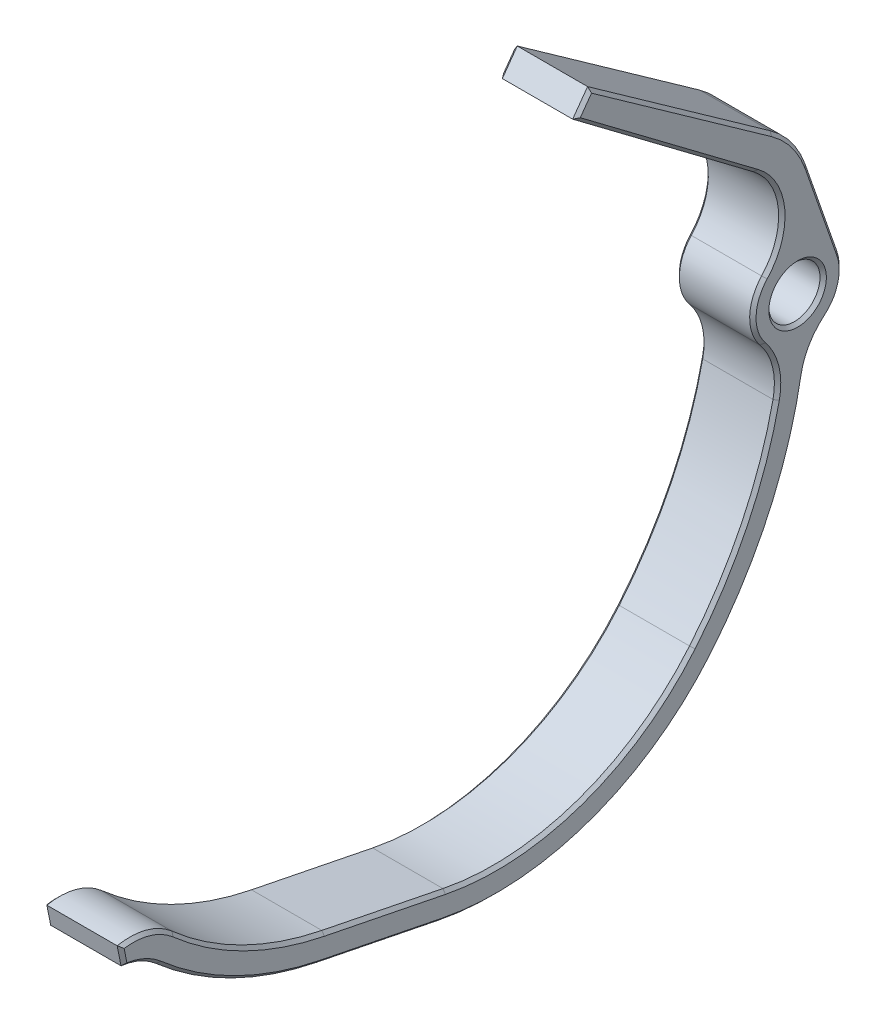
ISO-10303-21;
HEADER;
FILE_DESCRIPTION(('STEP AP214'),'2;1');
FILE_NAME('part.step','',(''),(''),'','','');
FILE_SCHEMA(('AUTOMOTIVE_DESIGN { 1 0 10303 214 1 1 1 1 }'));
ENDSEC;
DATA;
#1=APPLICATION_CONTEXT('core data for automotive mechanical design processes');
#2=APPLICATION_PROTOCOL_DEFINITION('international standard','automotive_design',2000,#1);
#3=PRODUCT_CONTEXT('',#1,'mechanical');
#4=PRODUCT('Part','Part','',(#3));
#5=PRODUCT_RELATED_PRODUCT_CATEGORY('part','',(#4));
#6=PRODUCT_DEFINITION_FORMATION('','',#4);
#7=PRODUCT_DEFINITION_CONTEXT('part definition',#1,'design');
#8=PRODUCT_DEFINITION('design','',#6,#7);
#9=PRODUCT_DEFINITION_SHAPE('','',#8);
#10=(LENGTH_UNIT() NAMED_UNIT(*) SI_UNIT(.MILLI.,.METRE.));
#11=(NAMED_UNIT(*) PLANE_ANGLE_UNIT() SI_UNIT($,.RADIAN.));
#12=(NAMED_UNIT(*) SI_UNIT($,.STERADIAN.) SOLID_ANGLE_UNIT());
#13=UNCERTAINTY_MEASURE_WITH_UNIT(LENGTH_MEASURE(1.E-05),#10,'distance_accuracy_value','');
#14=(GEOMETRIC_REPRESENTATION_CONTEXT(3) GLOBAL_UNCERTAINTY_ASSIGNED_CONTEXT((#13)) GLOBAL_UNIT_ASSIGNED_CONTEXT((#10,
#11,#12)) REPRESENTATION_CONTEXT('',''));
#15=CARTESIAN_POINT('',(0.,0.,0.));
#16=DIRECTION('',(0.,0.,1.));
#17=DIRECTION('',(1.,0.,0.));
#18=AXIS2_PLACEMENT_3D('',#15,#16,#17);
#19=CARTESIAN_POINT('',(6.,-24.2721501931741,53.235));
#20=DIRECTION('',(-1.,0.,0.));
#21=DIRECTION('',(0.,0.,1.));
#22=AXIS2_PLACEMENT_3D('',#19,#20,#21);
#23=CYLINDRICAL_SURFACE('',#22,5.);
#24=DIRECTION('',(-1.,0.,0.));
#25=VECTOR('',#24,1.);
#26=CARTESIAN_POINT('',(6.,-19.3033027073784,52.6777256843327));
#27=LINE('',#26,#25);
#28=CARTESIAN_POINT('',(5.74999999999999,-19.3033027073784,52.6777256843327));
#29=VERTEX_POINT('',#28);
#30=CARTESIAN_POINT('',(0.249999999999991,-19.3033027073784,52.6777256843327));
#31=VERTEX_POINT('',#30);
#32=EDGE_CURVE('E764',#29,#31,#27,.T.);
#33=ORIENTED_EDGE('',*,*,#32,.T.);
#34=CARTESIAN_POINT('',(0.249999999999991,-24.2721501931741,53.235));
#35=DIRECTION('',(1.,0.,0.));
#36=DIRECTION('',(0.,0.,-1.));
#37=AXIS2_PLACEMENT_3D('',#34,#35,#36);
#38=CIRCLE('',#37,5.);
#39=CARTESIAN_POINT('',(0.249999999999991,-20.5090261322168,49.9427519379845));
#40=VERTEX_POINT('',#39);
#41=EDGE_CURVE('E427',#31,#40,#38,.F.);
#42=ORIENTED_EDGE('',*,*,#41,.T.);
#43=DIRECTION('',(-1.,0.,0.));
#44=VECTOR('',#43,1.);
#45=CARTESIAN_POINT('',(6.,-20.5090261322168,49.9427519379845));
#46=LINE('',#45,#44);
#47=CARTESIAN_POINT('',(5.74999999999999,-20.5090261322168,49.9427519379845));
#48=VERTEX_POINT('',#47);
#49=EDGE_CURVE('E326',#48,#40,#46,.T.);
#50=ORIENTED_EDGE('',*,*,#49,.F.);
#51=CARTESIAN_POINT('',(5.74999999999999,-24.2721501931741,53.235));
#52=DIRECTION('',(1.,0.,0.));
#53=DIRECTION('',(0.,0.,-1.));
#54=AXIS2_PLACEMENT_3D('',#51,#52,#53);
#55=CIRCLE('',#54,5.);
#56=EDGE_CURVE('E425',#48,#29,#55,.T.);
#57=ORIENTED_EDGE('',*,*,#56,.T.);
#58=EDGE_LOOP('',(#33,#42,#50,#57));
#59=FACE_BOUND('',#58,.T.);
#60=ADVANCED_FACE('F33',(#59),#23,.F.);
#61=CARTESIAN_POINT('',(6.,0.,32.));
#62=DIRECTION('',(-1.,0.,0.));
#63=DIRECTION('',(0.,0.,1.));
#64=AXIS2_PLACEMENT_3D('',#61,#62,#63);
#65=CYLINDRICAL_SURFACE('',#64,27.25);
#66=ORIENTED_EDGE('',*,*,#49,.T.);
#67=CARTESIAN_POINT('',(0.249999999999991,0.,32.));
#68=DIRECTION('',(1.,0.,0.));
#69=DIRECTION('',(0.,0.,-1.));
#70=AXIS2_PLACEMENT_3D('',#67,#68,#69);
#71=CIRCLE('',#70,27.25);
#72=CARTESIAN_POINT('',(0.24999999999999,-26.7166792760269,37.36484375));
#73=VERTEX_POINT('',#72);
#74=EDGE_CURVE('E312',#40,#73,#71,.T.);
#75=ORIENTED_EDGE('',*,*,#74,.T.);
#76=DIRECTION('',(-1.,0.,0.));
#77=VECTOR('',#76,1.);
#78=CARTESIAN_POINT('',(6.,-26.7166792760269,37.36484375));
#79=LINE('',#78,#77);
#80=CARTESIAN_POINT('',(5.74999999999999,-26.7166792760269,37.36484375));
#81=VERTEX_POINT('',#80);
#82=EDGE_CURVE('E818',#81,#73,#79,.T.);
#83=ORIENTED_EDGE('',*,*,#82,.F.);
#84=CARTESIAN_POINT('',(5.74999999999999,0.,32.));
#85=DIRECTION('',(1.,0.,0.));
#86=DIRECTION('',(0.,0.,-1.));
#87=AXIS2_PLACEMENT_3D('',#84,#85,#86);
#88=CIRCLE('',#87,27.25);
#89=EDGE_CURVE('E345',#81,#48,#88,.F.);
#90=ORIENTED_EDGE('',*,*,#89,.T.);
#91=EDGE_LOOP('',(#66,#75,#83,#90));
#92=FACE_BOUND('',#91,.T.);
#93=ADVANCED_FACE('F668',(#92),#65,.T.);
#94=CARTESIAN_POINT('',(6.,-39.1408016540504,-24.5067238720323));
#95=DIRECTION('',(0.,0.980428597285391,-0.196875));
#96=DIRECTION('',(0.,0.196875,0.980428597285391));
#97=AXIS2_PLACEMENT_3D('',#94,#95,#96);
#98=PLANE('',#97);
#99=ORIENTED_EDGE('',*,*,#82,.T.);
#100=DIRECTION('',(0.,-0.196875,-0.980428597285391));
#101=VECTOR('',#100,1.);
#102=CARTESIAN_POINT('',(0.24999999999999,-39.1408016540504,-24.5067238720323));
#103=LINE('',#102,#101);
#104=CARTESIAN_POINT('',(0.249999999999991,-28.6197335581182,27.8877194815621));
#105=VERTEX_POINT('',#104);
#106=EDGE_CURVE('E350',#73,#105,#103,.T.);
#107=ORIENTED_EDGE('',*,*,#106,.T.);
#108=DIRECTION('',(-1.,0.,0.));
#109=VECTOR('',#108,1.);
#110=CARTESIAN_POINT('',(6.,-28.6197335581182,27.8877194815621));
#111=LINE('',#110,#109);
#112=CARTESIAN_POINT('',(5.74999999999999,-28.6197335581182,27.8877194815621));
#113=VERTEX_POINT('',#112);
#114=EDGE_CURVE('E705',#113,#105,#111,.T.);
#115=ORIENTED_EDGE('',*,*,#114,.F.);
#116=DIRECTION('',(0.,0.196875,0.980428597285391));
#117=VECTOR('',#116,1.);
#118=CARTESIAN_POINT('',(5.74999999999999,-26.7166792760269,37.36484375));
#119=LINE('',#118,#117);
#120=EDGE_CURVE('E348',#113,#81,#119,.T.);
#121=ORIENTED_EDGE('',*,*,#120,.T.);
#122=EDGE_LOOP('',(#99,#107,#115,#121));
#123=FACE_BOUND('',#122,.T.);
#124=ADVANCED_FACE('F674',(#123),#98,.F.);
#125=CARTESIAN_POINT('',(6.,-7.05030441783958,23.5564694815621));
#126=DIRECTION('',(-1.,0.,0.));
#127=DIRECTION('',(0.,0.,1.));
#128=AXIS2_PLACEMENT_3D('',#125,#126,#127);
#129=CYLINDRICAL_SURFACE('',#128,22.);
#130=ORIENTED_EDGE('',*,*,#114,.T.);
#131=CARTESIAN_POINT('',(0.249999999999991,-7.05030441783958,23.5564694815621));
#132=DIRECTION('',(1.,0.,0.));
#133=DIRECTION('',(0.,0.,-1.));
#134=AXIS2_PLACEMENT_3D('',#131,#132,#133);
#135=CIRCLE('',#134,22.);
#136=CARTESIAN_POINT('',(0.249999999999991,-21.1509132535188,6.66940844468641));
#137=VERTEX_POINT('',#136);
#138=EDGE_CURVE('E354',#105,#137,#135,.T.);
#139=ORIENTED_EDGE('',*,*,#138,.T.);
#140=DIRECTION('',(-1.,0.,0.));
#141=VECTOR('',#140,1.);
#142=CARTESIAN_POINT('',(6.,-21.1509132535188,6.66940844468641));
#143=LINE('',#142,#141);
#144=CARTESIAN_POINT('',(5.74999999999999,-21.1509132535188,6.66940844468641));
#145=VERTEX_POINT('',#144);
#146=EDGE_CURVE('E702',#145,#137,#143,.T.);
#147=ORIENTED_EDGE('',*,*,#146,.F.);
#148=CARTESIAN_POINT('',(5.74999999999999,-7.05030441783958,23.5564694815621));
#149=DIRECTION('',(1.,0.,0.));
#150=DIRECTION('',(0.,0.,-1.));
#151=AXIS2_PLACEMENT_3D('',#148,#149,#150);
#152=CIRCLE('',#151,22.);
#153=EDGE_CURVE('E352',#145,#113,#152,.F.);
#154=ORIENTED_EDGE('',*,*,#153,.T.);
#155=EDGE_LOOP('',(#130,#139,#147,#154));
#156=FACE_BOUND('',#155,.T.);
#157=ADVANCED_FACE('F701',(#156),#129,.T.);
#158=CARTESIAN_POINT('',(6.,0.,32.));
#159=DIRECTION('',(-1.,0.,0.));
#160=DIRECTION('',(0.,0.,1.));
#161=AXIS2_PLACEMENT_3D('',#158,#159,#160);
#162=CYLINDRICAL_SURFACE('',#161,33.);
#163=ORIENTED_EDGE('',*,*,#146,.T.);
#164=CARTESIAN_POINT('',(0.249999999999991,0.,32.));
#165=DIRECTION('',(1.,0.,0.));
#166=DIRECTION('',(0.,0.,-1.));
#167=AXIS2_PLACEMENT_3D('',#164,#165,#166);
#168=CIRCLE('',#167,33.);
#169=CARTESIAN_POINT('',(0.249999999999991,-5.67644927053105,-0.508120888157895));
#170=VERTEX_POINT('',#169);
#171=EDGE_CURVE('E358',#137,#170,#168,.T.);
#172=ORIENTED_EDGE('',*,*,#171,.T.);
#173=DIRECTION('',(-1.,0.,0.));
#174=VECTOR('',#173,1.);
#175=CARTESIAN_POINT('',(6.,-5.67644927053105,-0.508120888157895));
#176=LINE('',#175,#174);
#177=CARTESIAN_POINT('',(5.74999999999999,-5.67644927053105,-0.508120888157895));
#178=VERTEX_POINT('',#177);
#179=EDGE_CURVE('E712',#178,#170,#176,.T.);
#180=ORIENTED_EDGE('',*,*,#179,.F.);
#181=CARTESIAN_POINT('',(5.74999999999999,0.,32.));
#182=DIRECTION('',(1.,0.,0.));
#183=DIRECTION('',(0.,0.,-1.));
#184=AXIS2_PLACEMENT_3D('',#181,#182,#183);
#185=CIRCLE('',#184,33.);
#186=EDGE_CURVE('E356',#178,#145,#185,.F.);
#187=ORIENTED_EDGE('',*,*,#186,.T.);
#188=EDGE_LOOP('',(#163,#172,#180,#187));
#189=FACE_BOUND('',#188,.T.);
#190=ADVANCED_FACE('F708',(#189),#162,.T.);
#191=CARTESIAN_POINT('',(6.,-6.53651734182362,-5.43359375));
#192=DIRECTION('',(-1.,0.,0.));
#193=DIRECTION('',(0.,0.,1.));
#194=AXIS2_PLACEMENT_3D('',#191,#192,#193);
#195=CYLINDRICAL_SURFACE('',#194,5.);
#196=ORIENTED_EDGE('',*,*,#179,.T.);
#197=CARTESIAN_POINT('',(0.249999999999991,-6.53651734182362,-5.43359375));
#198=DIRECTION('',(1.,0.,0.));
#199=DIRECTION('',(0.,0.,-1.));
#200=AXIS2_PLACEMENT_3D('',#197,#198,#199);
#201=CIRCLE('',#200,5.);
#202=CARTESIAN_POINT('',(0.249999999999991,-2.6915071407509,-2.23736213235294));
#203=VERTEX_POINT('',#202);
#204=EDGE_CURVE('E362',#170,#203,#201,.F.);
#205=ORIENTED_EDGE('',*,*,#204,.T.);
#206=DIRECTION('',(-1.,0.,0.));
#207=VECTOR('',#206,1.);
#208=CARTESIAN_POINT('',(6.,-2.6915071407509,-2.23736213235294));
#209=LINE('',#208,#207);
#210=CARTESIAN_POINT('',(5.74999999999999,-2.6915071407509,-2.23736213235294));
#211=VERTEX_POINT('',#210);
#212=EDGE_CURVE('E813',#211,#203,#209,.T.);
#213=ORIENTED_EDGE('',*,*,#212,.F.);
#214=CARTESIAN_POINT('',(5.74999999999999,-6.53651734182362,-5.43359375));
#215=DIRECTION('',(1.,0.,0.));
#216=DIRECTION('',(0.,0.,-1.));
#217=AXIS2_PLACEMENT_3D('',#214,#215,#216);
#218=CIRCLE('',#217,5.);
#219=EDGE_CURVE('E360',#211,#178,#218,.T.);
#220=ORIENTED_EDGE('',*,*,#219,.T.);
#221=EDGE_LOOP('',(#196,#205,#213,#220));
#222=FACE_BOUND('',#221,.T.);
#223=ADVANCED_FACE('F953',(#222),#195,.F.);
#224=CARTESIAN_POINT('',(6.,0.,0.));
#225=DIRECTION('',(-1.,0.,0.));
#226=DIRECTION('',(0.,0.,1.));
#227=AXIS2_PLACEMENT_3D('',#224,#225,#226);
#228=CYLINDRICAL_SURFACE('',#227,3.5);
#229=ORIENTED_EDGE('',*,*,#212,.T.);
#230=CARTESIAN_POINT('',(0.249999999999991,0.,0.));
#231=DIRECTION('',(1.,0.,0.));
#232=DIRECTION('',(0.,0.,-1.));
#233=AXIS2_PLACEMENT_3D('',#230,#231,#232);
#234=CIRCLE('',#233,3.5);
#235=CARTESIAN_POINT('',(0.24999999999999,1.14961464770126,-3.30581096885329));
#236=VERTEX_POINT('',#235);
#237=EDGE_CURVE('E366',#203,#236,#234,.T.);
#238=ORIENTED_EDGE('',*,*,#237,.T.);
#239=DIRECTION('',(-1.,0.,0.));
#240=VECTOR('',#239,1.);
#241=CARTESIAN_POINT('',(6.,1.14961464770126,-3.30581096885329));
#242=LINE('',#241,#240);
#243=CARTESIAN_POINT('',(5.74999999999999,1.14961464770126,-3.30581096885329));
#244=VERTEX_POINT('',#243);
#245=EDGE_CURVE('E810',#244,#236,#242,.T.);
#246=ORIENTED_EDGE('',*,*,#245,.F.);
#247=CARTESIAN_POINT('',(5.74999999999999,0.,0.));
#248=DIRECTION('',(1.,0.,0.));
#249=DIRECTION('',(0.,0.,-1.));
#250=AXIS2_PLACEMENT_3D('',#247,#248,#249);
#251=CIRCLE('',#250,3.5);
#252=EDGE_CURVE('E364',#244,#211,#251,.F.);
#253=ORIENTED_EDGE('',*,*,#252,.T.);
#254=EDGE_LOOP('',(#229,#238,#246,#253));
#255=FACE_BOUND('',#254,.T.);
#256=ADVANCED_FACE('F860',(#255),#228,.T.);
#257=CARTESIAN_POINT('',(6.,-13.252963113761,-8.31438965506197));
#258=DIRECTION('',(0.,-0.328461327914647,0.944517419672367));
#259=DIRECTION('',(0.,-0.944517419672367,-0.328461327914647));
#260=AXIS2_PLACEMENT_3D('',#257,#258,#259);
#261=PLANE('',#260);
#262=ORIENTED_EDGE('',*,*,#245,.T.);
#263=DIRECTION('',(0.,0.944517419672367,0.328461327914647));
#264=VECTOR('',#263,1.);
#265=CARTESIAN_POINT('',(0.24999999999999,-13.252963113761,-8.31438965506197));
#266=LINE('',#265,#264);
#267=CARTESIAN_POINT('',(0.249999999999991,8.2378988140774,-0.840819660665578));
#268=VERTEX_POINT('',#267);
#269=EDGE_CURVE('E370',#236,#268,#266,.T.);
#270=ORIENTED_EDGE('',*,*,#269,.T.);
#271=DIRECTION('',(-1.,0.,0.));
#272=VECTOR('',#271,1.);
#273=CARTESIAN_POINT('',(6.,8.2378988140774,-0.840819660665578));
#274=LINE('',#273,#272);
#275=CARTESIAN_POINT('',(5.74999999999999,8.2378988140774,-0.840819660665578));
#276=VERTEX_POINT('',#275);
#277=EDGE_CURVE('E807',#276,#268,#274,.T.);
#278=ORIENTED_EDGE('',*,*,#277,.F.);
#279=DIRECTION('',(0.,-0.944517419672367,-0.328461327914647));
#280=VECTOR('',#279,1.);
#281=CARTESIAN_POINT('',(5.74999999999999,1.14961464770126,-3.30581096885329));
#282=LINE('',#281,#280);
#283=EDGE_CURVE('E368',#276,#244,#282,.T.);
#284=ORIENTED_EDGE('',*,*,#283,.T.);
#285=EDGE_LOOP('',(#262,#270,#278,#284));
#286=FACE_BOUND('',#285,.T.);
#287=ADVANCED_FACE('F865',(#286),#261,.F.);
#288=CARTESIAN_POINT('',(6.,5.77731417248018,6.23479277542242));
#289=DIRECTION('',(-1.,0.,0.));
#290=DIRECTION('',(0.,0.,1.));
#291=AXIS2_PLACEMENT_3D('',#288,#289,#290);
#292=CYLINDRICAL_SURFACE('',#291,7.49124609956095);
#293=ORIENTED_EDGE('',*,*,#277,.T.);
#294=CARTESIAN_POINT('',(0.249999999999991,5.77731417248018,6.23479277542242));
#295=DIRECTION('',(1.,0.,0.));
#296=DIRECTION('',(0.,0.,-1.));
#297=AXIS2_PLACEMENT_3D('',#294,#295,#296);
#298=CIRCLE('',#297,7.49124609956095);
#299=CARTESIAN_POINT('',(0.249999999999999,11.8878546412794,1.90119573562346));
#300=VERTEX_POINT('',#299);
#301=EDGE_CURVE('E374',#268,#300,#298,.T.);
#302=ORIENTED_EDGE('',*,*,#301,.T.);
#303=DIRECTION('',(-1.,0.,0.));
#304=VECTOR('',#303,1.);
#305=CARTESIAN_POINT('',(6.,11.8878546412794,1.90119573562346));
#306=LINE('',#305,#304);
#307=CARTESIAN_POINT('',(5.74999999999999,11.8878546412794,1.90119573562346));
#308=VERTEX_POINT('',#307);
#309=EDGE_CURVE('E804',#308,#300,#306,.T.);
#310=ORIENTED_EDGE('',*,*,#309,.F.);
#311=CARTESIAN_POINT('',(5.74999999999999,5.77731417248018,6.23479277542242));
#312=DIRECTION('',(1.,0.,0.));
#313=DIRECTION('',(0.,0.,-1.));
#314=AXIS2_PLACEMENT_3D('',#311,#312,#313);
#315=CIRCLE('',#314,7.49124609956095);
#316=EDGE_CURVE('E372',#308,#276,#315,.F.);
#317=ORIENTED_EDGE('',*,*,#316,.T.);
#318=EDGE_LOOP('',(#293,#302,#310,#317));
#319=FACE_BOUND('',#318,.T.);
#320=ADVANCED_FACE('F875',(#319),#292,.T.);
#321=CARTESIAN_POINT('',(6.,-9.52098925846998,-28.2861072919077));
#322=DIRECTION('',(0.,0.815690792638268,-0.578488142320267));
#323=DIRECTION('',(0.,0.578488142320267,0.815690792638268));
#324=AXIS2_PLACEMENT_3D('',#321,#322,#323);
#325=PLANE('',#324);
#326=ORIENTED_EDGE('',*,*,#309,.T.);
#327=DIRECTION('',(0.,0.578488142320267,0.815690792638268));
#328=VECTOR('',#327,1.);
#329=CARTESIAN_POINT('',(0.249999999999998,22.0148839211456,16.1807011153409));
#330=LINE('',#329,#328);
#331=CARTESIAN_POINT('',(0.249999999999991,22.0148839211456,16.1807011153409));
#332=VERTEX_POINT('',#331);
#333=EDGE_CURVE('E378',#300,#332,#330,.T.);
#334=ORIENTED_EDGE('',*,*,#333,.T.);
#335=DIRECTION('',(-1.,0.,0.));
#336=VECTOR('',#335,1.);
#337=CARTESIAN_POINT('',(6.,22.0148839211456,16.1807011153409));
#338=LINE('',#337,#336);
#339=CARTESIAN_POINT('',(5.74999999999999,22.0148839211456,16.1807011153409));
#340=VERTEX_POINT('',#339);
#341=EDGE_CURVE('E801',#340,#332,#338,.T.);
#342=ORIENTED_EDGE('',*,*,#341,.F.);
#343=DIRECTION('',(0.,-0.578488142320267,-0.815690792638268));
#344=VECTOR('',#343,1.);
#345=CARTESIAN_POINT('',(5.74999999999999,-9.52098925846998,-28.2861072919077));
#346=LINE('',#345,#344);
#347=EDGE_CURVE('E376',#340,#308,#346,.T.);
#348=ORIENTED_EDGE('',*,*,#347,.T.);
#349=EDGE_LOOP('',(#326,#334,#342,#348));
#350=FACE_BOUND('',#349,.T.);
#351=ADVANCED_FACE('F879',(#350),#325,.T.);
#352=CARTESIAN_POINT('',(6.,26.5360239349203,12.9319324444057));
#353=DIRECTION('',(0.,0.583541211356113,0.812083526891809));
#354=DIRECTION('',(0.,-0.81208352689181,0.583541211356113));
#355=AXIS2_PLACEMENT_3D('',#352,#353,#354);
#356=PLANE('',#355);
#357=ORIENTED_EDGE('',*,*,#341,.T.);
#358=DIRECTION('',(0.,-0.81208352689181,0.583541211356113));
#359=VECTOR('',#358,1.);
#360=CARTESIAN_POINT('',(0.249999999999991,20.390716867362,17.3477835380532));
#361=LINE('',#360,#359);
#362=CARTESIAN_POINT('',(0.249999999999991,20.390716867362,17.3477835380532));
#363=VERTEX_POINT('',#362);
#364=EDGE_CURVE('E382',#332,#363,#361,.T.);
#365=ORIENTED_EDGE('',*,*,#364,.T.);
#366=DIRECTION('',(-1.,0.,0.));
#367=VECTOR('',#366,1.);
#368=CARTESIAN_POINT('',(6.,20.390716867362,17.3477835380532));
#369=LINE('',#368,#367);
#370=CARTESIAN_POINT('',(5.74999999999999,20.390716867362,17.3477835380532));
#371=VERTEX_POINT('',#370);
#372=EDGE_CURVE('E798',#371,#363,#369,.T.);
#373=ORIENTED_EDGE('',*,*,#372,.F.);
#374=DIRECTION('',(0.,0.81208352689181,-0.583541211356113));
#375=VECTOR('',#374,1.);
#376=CARTESIAN_POINT('',(5.74999999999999,26.5360239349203,12.9319324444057));
#377=LINE('',#376,#375);
#378=EDGE_CURVE('E380',#371,#340,#377,.T.);
#379=ORIENTED_EDGE('',*,*,#378,.T.);
#380=EDGE_LOOP('',(#357,#365,#373,#379));
#381=FACE_BOUND('',#380,.T.);
#382=ADVANCED_FACE('F889',(#381),#356,.T.);
#383=CARTESIAN_POINT('',(6.,-12.2478167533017,-26.0527700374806));
#384=DIRECTION('',(0.,0.799220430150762,-0.60103802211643));
#385=DIRECTION('',(0.,0.60103802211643,0.799220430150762));
#386=AXIS2_PLACEMENT_3D('',#383,#384,#385);
#387=PLANE('',#386);
#388=ORIENTED_EDGE('',*,*,#372,.T.);
#389=DIRECTION('',(0.,-0.60103802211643,-0.799220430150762));
#390=VECTOR('',#389,1.);
#391=CARTESIAN_POINT('',(0.249999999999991,-12.2478167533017,-26.0527700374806));
#392=LINE('',#391,#390);
#393=CARTESIAN_POINT('',(0.249999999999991,9.77341632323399,3.22960266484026));
#394=VERTEX_POINT('',#393);
#395=EDGE_CURVE('E386',#363,#394,#392,.T.);
#396=ORIENTED_EDGE('',*,*,#395,.T.);
#397=DIRECTION('',(-1.,0.,0.));
#398=VECTOR('',#397,1.);
#399=CARTESIAN_POINT('',(6.,9.77341632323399,3.22960266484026));
#400=LINE('',#399,#398);
#401=CARTESIAN_POINT('',(5.74999999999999,9.77341632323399,3.22960266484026));
#402=VERTEX_POINT('',#401);
#403=EDGE_CURVE('E795',#402,#394,#400,.T.);
#404=ORIENTED_EDGE('',*,*,#403,.F.);
#405=DIRECTION('',(0.,0.60103802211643,0.799220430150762));
#406=VECTOR('',#405,1.);
#407=CARTESIAN_POINT('',(5.74999999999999,20.390716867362,17.3477835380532));
#408=LINE('',#407,#406);
#409=EDGE_CURVE('E384',#402,#371,#408,.T.);
#410=ORIENTED_EDGE('',*,*,#409,.T.);
#411=EDGE_LOOP('',(#388,#396,#404,#410));
#412=FACE_BOUND('',#411,.T.);
#413=ADVANCED_FACE('F892',(#412),#387,.F.);
#414=CARTESIAN_POINT('',(6.,5.77731417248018,6.23479277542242));
#415=DIRECTION('',(-1.,0.,0.));
#416=DIRECTION('',(0.,0.,1.));
#417=AXIS2_PLACEMENT_3D('',#414,#415,#416);
#418=CYLINDRICAL_SURFACE('',#417,5.);
#419=ORIENTED_EDGE('',*,*,#403,.T.);
#420=CARTESIAN_POINT('',(0.249999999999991,5.77731417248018,6.23479277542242));
#421=DIRECTION('',(1.,0.,0.));
#422=DIRECTION('',(0.,0.,-1.));
#423=AXIS2_PLACEMENT_3D('',#420,#421,#422);
#424=CIRCLE('',#423,5.);
#425=CARTESIAN_POINT('',(0.249999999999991,2.37889407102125,2.56726761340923));
#426=VERTEX_POINT('',#425);
#427=EDGE_CURVE('E390',#394,#426,#424,.F.);
#428=ORIENTED_EDGE('',*,*,#427,.T.);
#429=DIRECTION('',(-1.,0.,0.));
#430=VECTOR('',#429,1.);
#431=CARTESIAN_POINT('',(6.,2.37889407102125,2.56726761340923));
#432=LINE('',#431,#430);
#433=CARTESIAN_POINT('',(5.74999999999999,2.37889407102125,2.56726761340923));
#434=VERTEX_POINT('',#433);
#435=EDGE_CURVE('E792',#434,#426,#432,.T.);
#436=ORIENTED_EDGE('',*,*,#435,.F.);
#437=CARTESIAN_POINT('',(5.74999999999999,5.77731417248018,6.23479277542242));
#438=DIRECTION('',(1.,0.,0.));
#439=DIRECTION('',(0.,0.,-1.));
#440=AXIS2_PLACEMENT_3D('',#437,#438,#439);
#441=CIRCLE('',#440,5.);
#442=EDGE_CURVE('E388',#434,#402,#441,.T.);
#443=ORIENTED_EDGE('',*,*,#442,.T.);
#444=EDGE_LOOP('',(#419,#428,#436,#443));
#445=FACE_BOUND('',#444,.T.);
#446=ADVANCED_FACE('F899',(#445),#418,.F.);
#447=CARTESIAN_POINT('',(6.,0.,0.));
#448=DIRECTION('',(-1.,0.,0.));
#449=DIRECTION('',(0.,0.,1.));
#450=AXIS2_PLACEMENT_3D('',#447,#448,#449);
#451=CYLINDRICAL_SURFACE('',#450,3.5);
#452=ORIENTED_EDGE('',*,*,#435,.T.);
#453=CARTESIAN_POINT('',(0.249999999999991,0.,0.));
#454=DIRECTION('',(1.,0.,0.));
#455=DIRECTION('',(0.,0.,-1.));
#456=AXIS2_PLACEMENT_3D('',#453,#454,#455);
#457=CIRCLE('',#456,3.5);
#458=CARTESIAN_POINT('',(0.249999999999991,-2.22247340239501,2.7038143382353));
#459=VERTEX_POINT('',#458);
#460=EDGE_CURVE('E394',#426,#459,#457,.T.);
#461=ORIENTED_EDGE('',*,*,#460,.T.);
#462=DIRECTION('',(-1.,0.,0.));
#463=VECTOR('',#462,1.);
#464=CARTESIAN_POINT('',(6.,-2.22247340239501,2.7038143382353));
#465=LINE('',#464,#463);
#466=CARTESIAN_POINT('',(5.74999999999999,-2.22247340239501,2.7038143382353));
#467=VERTEX_POINT('',#466);
#468=EDGE_CURVE('E789',#467,#459,#465,.T.);
#469=ORIENTED_EDGE('',*,*,#468,.F.);
#470=CARTESIAN_POINT('',(5.74999999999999,0.,0.));
#471=DIRECTION('',(1.,0.,0.));
#472=DIRECTION('',(0.,0.,-1.));
#473=AXIS2_PLACEMENT_3D('',#470,#471,#472);
#474=CIRCLE('',#473,3.5);
#475=EDGE_CURVE('E392',#467,#434,#474,.F.);
#476=ORIENTED_EDGE('',*,*,#475,.T.);
#477=EDGE_LOOP('',(#452,#461,#469,#476));
#478=FACE_BOUND('',#477,.T.);
#479=ADVANCED_FACE('F902',(#478),#451,.T.);
#480=CARTESIAN_POINT('',(6.,-5.39743540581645,6.56640625));
#481=DIRECTION('',(-1.,0.,0.));
#482=DIRECTION('',(0.,0.,1.));
#483=AXIS2_PLACEMENT_3D('',#480,#481,#482);
#484=CYLINDRICAL_SURFACE('',#483,5.);
#485=ORIENTED_EDGE('',*,*,#468,.T.);
#486=CARTESIAN_POINT('',(0.249999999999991,-5.39743540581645,6.56640625));
#487=DIRECTION('',(1.,0.,0.));
#488=DIRECTION('',(0.,0.,-1.));
#489=AXIS2_PLACEMENT_3D('',#486,#487,#488);
#490=CIRCLE('',#489,5.);
#491=CARTESIAN_POINT('',(0.249999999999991,-6.43540375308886,1.67533052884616));
#492=VERTEX_POINT('',#491);
#493=EDGE_CURVE('E398',#459,#492,#490,.F.);
#494=ORIENTED_EDGE('',*,*,#493,.T.);
#495=DIRECTION('',(-1.,0.,0.));
#496=VECTOR('',#495,1.);
#497=CARTESIAN_POINT('',(6.,-6.43540375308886,1.67533052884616));
#498=LINE('',#497,#496);
#499=CARTESIAN_POINT('',(5.74999999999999,-6.43540375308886,1.67533052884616));
#500=VERTEX_POINT('',#499);
#501=EDGE_CURVE('E786',#500,#492,#498,.T.);
#502=ORIENTED_EDGE('',*,*,#501,.F.);
#503=CARTESIAN_POINT('',(5.74999999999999,-5.39743540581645,6.56640625));
#504=DIRECTION('',(1.,0.,0.));
#505=DIRECTION('',(0.,0.,-1.));
#506=AXIS2_PLACEMENT_3D('',#503,#504,#505);
#507=CIRCLE('',#506,5.);
#508=EDGE_CURVE('E396',#500,#467,#507,.T.);
#509=ORIENTED_EDGE('',*,*,#508,.T.);
#510=EDGE_LOOP('',(#485,#494,#502,#509));
#511=FACE_BOUND('',#510,.T.);
#512=ADVANCED_FACE('F1014',(#511),#484,.F.);
#513=CARTESIAN_POINT('',(6.,0.,32.));
#514=DIRECTION('',(-1.,0.,0.));
#515=DIRECTION('',(0.,0.,1.));
#516=AXIS2_PLACEMENT_3D('',#513,#514,#515);
#517=CYLINDRICAL_SURFACE('',#516,31.);
#518=ORIENTED_EDGE('',*,*,#501,.T.);
#519=CARTESIAN_POINT('',(0.249999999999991,0.,32.));
#520=DIRECTION('',(1.,0.,0.));
#521=DIRECTION('',(0.,0.,-1.));
#522=AXIS2_PLACEMENT_3D('',#519,#520,#521);
#523=CIRCLE('',#522,31.);
#524=CARTESIAN_POINT('',(0.249999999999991,-19.8690397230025,8.20459581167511));
#525=VERTEX_POINT('',#524);
#526=EDGE_CURVE('E402',#492,#525,#523,.F.);
#527=ORIENTED_EDGE('',*,*,#526,.T.);
#528=DIRECTION('',(-1.,0.,0.));
#529=VECTOR('',#528,1.);
#530=CARTESIAN_POINT('',(6.,-19.8690397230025,8.20459581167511));
#531=LINE('',#530,#529);
#532=CARTESIAN_POINT('',(5.74999999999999,-19.8690397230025,8.20459581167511));
#533=VERTEX_POINT('',#532);
#534=EDGE_CURVE('E783',#533,#525,#531,.T.);
#535=ORIENTED_EDGE('',*,*,#534,.F.);
#536=CARTESIAN_POINT('',(5.74999999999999,0.,32.));
#537=DIRECTION('',(1.,0.,0.));
#538=DIRECTION('',(0.,0.,-1.));
#539=AXIS2_PLACEMENT_3D('',#536,#537,#538);
#540=CIRCLE('',#539,31.);
#541=EDGE_CURVE('E400',#533,#500,#540,.T.);
#542=ORIENTED_EDGE('',*,*,#541,.T.);
#543=EDGE_LOOP('',(#518,#527,#535,#542));
#544=FACE_BOUND('',#543,.T.);
#545=ADVANCED_FACE('F1016',(#544),#517,.F.);
#546=CARTESIAN_POINT('',(6.,-7.05030441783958,23.5564694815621));
#547=DIRECTION('',(-1.,0.,0.));
#548=DIRECTION('',(0.,0.,1.));
#549=AXIS2_PLACEMENT_3D('',#546,#547,#548);
#550=CYLINDRICAL_SURFACE('',#549,20.);
#551=ORIENTED_EDGE('',*,*,#534,.T.);
#552=CARTESIAN_POINT('',(0.249999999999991,-7.05030441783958,23.5564694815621));
#553=DIRECTION('',(1.,0.,0.));
#554=DIRECTION('',(0.,0.,-1.));
#555=AXIS2_PLACEMENT_3D('',#552,#553,#554);
#556=CIRCLE('',#555,20.);
#557=CARTESIAN_POINT('',(0.24999999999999,-26.6588763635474,27.4939694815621));
#558=VERTEX_POINT('',#557);
#559=EDGE_CURVE('E406',#525,#558,#556,.F.);
#560=ORIENTED_EDGE('',*,*,#559,.T.);
#561=DIRECTION('',(-1.,0.,0.));
#562=VECTOR('',#561,1.);
#563=CARTESIAN_POINT('',(6.,-26.6588763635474,27.4939694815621));
#564=LINE('',#563,#562);
#565=CARTESIAN_POINT('',(5.74999999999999,-26.6588763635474,27.4939694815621));
#566=VERTEX_POINT('',#565);
#567=EDGE_CURVE('E780',#566,#558,#564,.T.);
#568=ORIENTED_EDGE('',*,*,#567,.F.);
#569=CARTESIAN_POINT('',(5.74999999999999,-7.05030441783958,23.5564694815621));
#570=DIRECTION('',(1.,0.,0.));
#571=DIRECTION('',(0.,0.,-1.));
#572=AXIS2_PLACEMENT_3D('',#569,#570,#571);
#573=CIRCLE('',#572,20.);
#574=EDGE_CURVE('E404',#566,#533,#573,.T.);
#575=ORIENTED_EDGE('',*,*,#574,.T.);
#576=EDGE_LOOP('',(#551,#560,#568,#575));
#577=FACE_BOUND('',#576,.T.);
#578=ADVANCED_FACE('F1040',(#577),#550,.F.);
#579=CARTESIAN_POINT('',(6.,-37.1799444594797,-24.9004738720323));
#580=DIRECTION('',(0.,0.980428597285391,-0.196875));
#581=DIRECTION('',(0.,0.196875,0.980428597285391));
#582=AXIS2_PLACEMENT_3D('',#579,#580,#581);
#583=PLANE('',#582);
#584=ORIENTED_EDGE('',*,*,#567,.T.);
#585=DIRECTION('',(0.,0.196875,0.980428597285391));
#586=VECTOR('',#585,1.);
#587=CARTESIAN_POINT('',(0.24999999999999,-24.7558220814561,36.97109375));
#588=LINE('',#587,#586);
#589=CARTESIAN_POINT('',(0.249999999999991,-24.7558220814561,36.97109375));
#590=VERTEX_POINT('',#589);
#591=EDGE_CURVE('E410',#558,#590,#588,.T.);
#592=ORIENTED_EDGE('',*,*,#591,.T.);
#593=DIRECTION('',(-1.,0.,0.));
#594=VECTOR('',#593,1.);
#595=CARTESIAN_POINT('',(6.,-24.7558220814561,36.97109375));
#596=LINE('',#595,#594);
#597=CARTESIAN_POINT('',(5.74999999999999,-24.7558220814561,36.97109375));
#598=VERTEX_POINT('',#597);
#599=EDGE_CURVE('E777',#598,#590,#596,.T.);
#600=ORIENTED_EDGE('',*,*,#599,.F.);
#601=DIRECTION('',(0.,-0.196875,-0.980428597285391));
#602=VECTOR('',#601,1.);
#603=CARTESIAN_POINT('',(5.74999999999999,-37.1799444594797,-24.9004738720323));
#604=LINE('',#603,#602);
#605=EDGE_CURVE('E408',#598,#566,#604,.T.);
#606=ORIENTED_EDGE('',*,*,#605,.T.);
#607=EDGE_LOOP('',(#584,#592,#600,#606));
#608=FACE_BOUND('',#607,.T.);
#609=ADVANCED_FACE('F1038',(#608),#583,.T.);
#610=CARTESIAN_POINT('',(6.,0.,32.));
#611=DIRECTION('',(-1.,0.,0.));
#612=DIRECTION('',(0.,0.,1.));
#613=AXIS2_PLACEMENT_3D('',#610,#611,#612);
#614=CYLINDRICAL_SURFACE('',#613,25.25);
#615=ORIENTED_EDGE('',*,*,#599,.T.);
#616=CARTESIAN_POINT('',(0.249999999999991,0.,32.));
#617=DIRECTION('',(1.,0.,0.));
#618=DIRECTION('',(0.,0.,-1.));
#619=AXIS2_PLACEMENT_3D('',#616,#617,#618);
#620=CIRCLE('',#619,25.25);
#621=CARTESIAN_POINT('',(0.249999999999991,-18.9437506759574,48.6942148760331));
#622=VERTEX_POINT('',#621);
#623=EDGE_CURVE('E414',#590,#622,#620,.F.);
#624=ORIENTED_EDGE('',*,*,#623,.T.);
#625=DIRECTION('',(-1.,0.,0.));
#626=VECTOR('',#625,1.);
#627=CARTESIAN_POINT('',(6.,-18.9437506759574,48.6942148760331));
#628=LINE('',#627,#626);
#629=CARTESIAN_POINT('',(5.74999999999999,-18.9437506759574,48.6942148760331));
#630=VERTEX_POINT('',#629);
#631=EDGE_CURVE('E772',#630,#622,#628,.T.);
#632=ORIENTED_EDGE('',*,*,#631,.F.);
#633=CARTESIAN_POINT('',(5.74999999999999,0.,32.));
#634=DIRECTION('',(1.,0.,0.));
#635=DIRECTION('',(0.,0.,-1.));
#636=AXIS2_PLACEMENT_3D('',#633,#634,#635);
#637=CIRCLE('',#636,25.25);
#638=EDGE_CURVE('E412',#630,#598,#637,.T.);
#639=ORIENTED_EDGE('',*,*,#638,.T.);
#640=EDGE_LOOP('',(#615,#624,#632,#639));
#641=FACE_BOUND('',#640,.T.);
#642=ADVANCED_FACE('F1047',(#641),#614,.F.);
#643=CARTESIAN_POINT('',(6.,-22.6949884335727,52.));
#644=DIRECTION('',(-1.,0.,0.));
#645=DIRECTION('',(0.,0.,1.));
#646=AXIS2_PLACEMENT_3D('',#643,#644,#645);
#647=CYLINDRICAL_SURFACE('',#646,5.00000000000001);
#648=ORIENTED_EDGE('',*,*,#631,.T.);
#649=CARTESIAN_POINT('',(0.249999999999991,-22.6949884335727,52.));
#650=DIRECTION('',(1.,0.,0.));
#651=DIRECTION('',(0.,0.,-1.));
#652=AXIS2_PLACEMENT_3D('',#649,#650,#651);
#653=CIRCLE('',#652,5.00000000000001);
#654=CARTESIAN_POINT('',(0.249999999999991,-17.7919151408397,52.9797307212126));
#655=VERTEX_POINT('',#654);
#656=EDGE_CURVE('E418',#622,#655,#653,.T.);
#657=ORIENTED_EDGE('',*,*,#656,.T.);
#658=DIRECTION('',(-1.,0.,0.));
#659=VECTOR('',#658,1.);
#660=CARTESIAN_POINT('',(6.,-17.7919151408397,52.9797307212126));
#661=LINE('',#660,#659);
#662=CARTESIAN_POINT('',(5.74999999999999,-17.7919151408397,52.9797307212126));
#663=VERTEX_POINT('',#662);
#664=EDGE_CURVE('E768',#663,#655,#661,.T.);
#665=ORIENTED_EDGE('',*,*,#664,.F.);
#666=CARTESIAN_POINT('',(5.74999999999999,-22.6949884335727,52.));
#667=DIRECTION('',(1.,0.,0.));
#668=DIRECTION('',(0.,0.,-1.));
#669=AXIS2_PLACEMENT_3D('',#666,#667,#668);
#670=CIRCLE('',#669,5.00000000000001);
#671=EDGE_CURVE('E416',#663,#630,#670,.F.);
#672=ORIENTED_EDGE('',*,*,#671,.T.);
#673=EDGE_LOOP('',(#648,#657,#665,#672));
#674=FACE_BOUND('',#673,.T.);
#675=ADVANCED_FACE('F993',(#674),#647,.T.);
#676=CARTESIAN_POINT('',(6.,-21.9333499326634,52.1521903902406));
#677=DIRECTION('',(0.,-0.195946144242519,0.980614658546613));
#678=DIRECTION('',(0.,-0.980614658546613,-0.195946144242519));
#679=AXIS2_PLACEMENT_3D('',#676,#677,#678);
#680=PLANE('',#679);
#681=ORIENTED_EDGE('',*,*,#664,.T.);
#682=DIRECTION('',(0.,-0.980614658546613,-0.195946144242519));
#683=VECTOR('',#682,1.);
#684=CARTESIAN_POINT('',(0.249999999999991,-19.3033027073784,52.6777256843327));
#685=LINE('',#684,#683);
#686=EDGE_CURVE('E423',#655,#31,#685,.T.);
#687=ORIENTED_EDGE('',*,*,#686,.T.);
#688=ORIENTED_EDGE('',*,*,#32,.F.);
#689=DIRECTION('',(0.,0.980614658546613,0.195946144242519));
#690=VECTOR('',#689,1.);
#691=CARTESIAN_POINT('',(5.74999999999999,-21.9333499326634,52.1521903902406));
#692=LINE('',#691,#690);
#693=EDGE_CURVE('E420',#29,#663,#692,.T.);
#694=ORIENTED_EDGE('',*,*,#693,.T.);
#695=EDGE_LOOP('',(#681,#687,#688,#694));
#696=FACE_BOUND('',#695,.T.);
#697=ADVANCED_FACE('F987',(#696),#680,.T.);
#698=CARTESIAN_POINT('',(6.,0.,0.));
#699=DIRECTION('',(-1.,0.,0.));
#700=DIRECTION('',(0.,0.,1.));
#701=AXIS2_PLACEMENT_3D('',#698,#699,#700);
#702=CYLINDRICAL_SURFACE('',#701,2.);
#703=CARTESIAN_POINT('',(0.249999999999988,0.,0.));
#704=DIRECTION('',(1.,0.,0.));
#705=DIRECTION('',(0.,0.,-1.));
#706=AXIS2_PLACEMENT_3D('',#703,#704,#705);
#707=CIRCLE('',#706,2.);
#708=CARTESIAN_POINT('',(0.249999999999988,0.,-2.));
#709=VERTEX_POINT('',#708);
#710=EDGE_CURVE('E342',#709,#709,#707,.F.);
#711=ORIENTED_EDGE('',*,*,#710,.T.);
#712=EDGE_LOOP('',(#711));
#713=FACE_BOUND('',#712,.T.);
#714=CARTESIAN_POINT('',(5.75000000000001,0.,0.));
#715=DIRECTION('',(1.,0.,0.));
#716=DIRECTION('',(0.,0.,-1.));
#717=AXIS2_PLACEMENT_3D('',#714,#715,#716);
#718=CIRCLE('',#717,2.);
#719=CARTESIAN_POINT('',(5.75000000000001,0.,-2.));
#720=VERTEX_POINT('',#719);
#721=EDGE_CURVE('E334',#720,#720,#718,.T.);
#722=ORIENTED_EDGE('',*,*,#721,.T.);
#723=EDGE_LOOP('',(#722));
#724=FACE_BOUND('',#723,.T.);
#725=ADVANCED_FACE('F1166',(#713,#724),#702,.F.);
#726=CARTESIAN_POINT('',(6.,-5.25575647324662,-31.3110115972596));
#727=DIRECTION('',(1.,0.,0.));
#728=DIRECTION('',(0.,0.,-1.));
#729=AXIS2_PLACEMENT_3D('',#726,#727,#728);
#730=PLANE('',#729);
#731=CARTESIAN_POINT('',(6.,0.,0.));
#732=DIRECTION('',(1.,0.,0.));
#733=DIRECTION('',(0.,0.,-1.));
#734=AXIS2_PLACEMENT_3D('',#731,#732,#733);
#735=CIRCLE('',#734,2.25);
#736=CARTESIAN_POINT('',(6.,0.,-2.25));
#737=VERTEX_POINT('',#736);
#738=EDGE_CURVE('E11',#737,#737,#735,.F.);
#739=ORIENTED_EDGE('',*,*,#738,.T.);
#740=EDGE_LOOP('',(#739));
#741=FACE_BOUND('',#740,.T.);
#742=CARTESIAN_POINT('',(6.,-22.6949884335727,52.));
#743=DIRECTION('',(1.,0.,0.));
#744=DIRECTION('',(0.,0.,-1.));
#745=AXIS2_PLACEMENT_3D('',#742,#743,#744);
#746=CIRCLE('',#745,4.75);
#747=CARTESIAN_POINT('',(6.,-19.1313125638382,48.8595041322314));
#748=VERTEX_POINT('',#747);
#749=CARTESIAN_POINT('',(6.,-17.9945381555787,52.6843005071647));
#750=VERTEX_POINT('',#749);
#751=EDGE_CURVE('E50',#748,#750,#746,.T.);
#752=ORIENTED_EDGE('',*,*,#751,.T.);
#753=DIRECTION('',(0.,-0.980614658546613,-0.195946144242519));
#754=VECTOR('',#753,1.);
#755=CARTESIAN_POINT('',(6.,-21.8843633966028,51.9070367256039));
#756=LINE('',#755,#754);
#757=CARTESIAN_POINT('',(6.,-19.0785244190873,52.4676986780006));
#758=VERTEX_POINT('',#757);
#759=EDGE_CURVE('E42',#750,#758,#756,.T.);
#760=ORIENTED_EDGE('',*,*,#759,.T.);
#761=CARTESIAN_POINT('',(6.,-24.2721501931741,53.235));
#762=DIRECTION('',(1.,0.,0.));
#763=DIRECTION('',(0.,0.,-1.));
#764=AXIS2_PLACEMENT_3D('',#761,#762,#763);
#765=CIRCLE('',#764,5.25000000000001);
#766=CARTESIAN_POINT('',(6.,-20.320869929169,49.7781395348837));
#767=VERTEX_POINT('',#766);
#768=EDGE_CURVE('E429',#758,#767,#765,.F.);
#769=ORIENTED_EDGE('',*,*,#768,.T.);
#770=CARTESIAN_POINT('',(6.,0.,32.));
#771=DIRECTION('',(1.,0.,0.));
#772=DIRECTION('',(0.,0.,-1.));
#773=AXIS2_PLACEMENT_3D('',#770,#771,#772);
#774=CIRCLE('',#773,27.);
#775=CARTESIAN_POINT('',(6.,-26.4715721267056,37.315625));
#776=VERTEX_POINT('',#775);
#777=EDGE_CURVE('E431',#767,#776,#774,.T.);
#778=ORIENTED_EDGE('',*,*,#777,.T.);
#779=DIRECTION('',(0.,-0.196875,-0.980428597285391));
#780=VECTOR('',#779,1.);
#781=CARTESIAN_POINT('',(6.,-28.3746264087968,27.8385007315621));
#782=LINE('',#781,#780);
#783=CARTESIAN_POINT('',(6.,-28.3746264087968,27.8385007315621));
#784=VERTEX_POINT('',#783);
#785=EDGE_CURVE('E433',#776,#784,#782,.T.);
#786=ORIENTED_EDGE('',*,*,#785,.T.);
#787=CARTESIAN_POINT('',(6.,-7.05030441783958,23.5564694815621));
#788=DIRECTION('',(1.,0.,0.));
#789=DIRECTION('',(0.,0.,-1.));
#790=AXIS2_PLACEMENT_3D('',#787,#788,#789);
#791=CIRCLE('',#790,21.75);
#792=CARTESIAN_POINT('',(6.,-20.9906790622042,6.86130686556));
#793=VERTEX_POINT('',#792);
#794=EDGE_CURVE('E435',#784,#793,#791,.T.);
#795=ORIENTED_EDGE('',*,*,#794,.T.);
#796=CARTESIAN_POINT('',(6.,0.,32.));
#797=DIRECTION('',(1.,0.,0.));
#798=DIRECTION('',(0.,0.,-1.));
#799=AXIS2_PLACEMENT_3D('',#796,#797,#798);
#800=CIRCLE('',#799,32.75);
#801=CARTESIAN_POINT('',(6.,-5.63344586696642,-0.261847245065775));
#802=VERTEX_POINT('',#801);
#803=EDGE_CURVE('E437',#793,#802,#800,.T.);
#804=ORIENTED_EDGE('',*,*,#803,.T.);
#805=CARTESIAN_POINT('',(6.,-6.53651734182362,-5.43359375));
#806=DIRECTION('',(1.,0.,0.));
#807=DIRECTION('',(0.,0.,-1.));
#808=AXIS2_PLACEMENT_3D('',#805,#806,#807);
#809=CIRCLE('',#808,5.25000000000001);
#810=CARTESIAN_POINT('',(6.,-2.49925663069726,-2.07755055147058));
#811=VERTEX_POINT('',#810);
#812=EDGE_CURVE('E439',#802,#811,#809,.F.);
#813=ORIENTED_EDGE('',*,*,#812,.T.);
#814=CARTESIAN_POINT('',(6.,0.,0.));
#815=DIRECTION('',(1.,0.,0.));
#816=DIRECTION('',(0.,0.,-1.));
#817=AXIS2_PLACEMENT_3D('',#814,#815,#816);
#818=CIRCLE('',#817,3.24999999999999);
#819=CARTESIAN_POINT('',(6.,1.0674993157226,-3.06968161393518));
#820=VERTEX_POINT('',#819);
#821=EDGE_CURVE('E441',#811,#820,#818,.T.);
#822=ORIENTED_EDGE('',*,*,#821,.T.);
#823=DIRECTION('',(0.,0.944517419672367,0.328461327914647));
#824=VECTOR('',#823,1.);
#825=CARTESIAN_POINT('',(6.,8.15578348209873,-0.604690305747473));
#826=LINE('',#825,#824);
#827=CARTESIAN_POINT('',(6.,8.15578348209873,-0.604690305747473));
#828=VERTEX_POINT('',#827);
#829=EDGE_CURVE('E443',#820,#828,#826,.T.);
#830=ORIENTED_EDGE('',*,*,#829,.T.);
#831=CARTESIAN_POINT('',(6.,5.77731417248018,6.23479277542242));
#832=DIRECTION('',(1.,0.,0.));
#833=DIRECTION('',(0.,0.,-1.));
#834=AXIS2_PLACEMENT_3D('',#831,#832,#833);
#835=CIRCLE('',#834,7.24124609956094);
#836=CARTESIAN_POINT('',(6.,11.6839319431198,2.04581777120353));
#837=VERTEX_POINT('',#836);
#838=EDGE_CURVE('E445',#828,#837,#835,.T.);
#839=ORIENTED_EDGE('',*,*,#838,.T.);
#840=DIRECTION('',(0.,0.578488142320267,0.815690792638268));
#841=VECTOR('',#840,1.);
#842=CARTESIAN_POINT('',(6.,-9.72491195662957,-28.1414852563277));
#843=LINE('',#842,#841);
#844=CARTESIAN_POINT('',(6.,21.6672343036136,16.1226626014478));
#845=VERTEX_POINT('',#844);
#846=EDGE_CURVE('E447',#837,#845,#843,.T.);
#847=ORIENTED_EDGE('',*,*,#846,.T.);
#848=DIRECTION('',(0.,-0.81208352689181,0.583541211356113));
#849=VECTOR('',#848,1.);
#850=CARTESIAN_POINT('',(6.,26.3901386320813,12.7289115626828));
#851=LINE('',#850,#849);
#852=CARTESIAN_POINT('',(6.,20.4434906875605,17.0020115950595));
#853=VERTEX_POINT('',#852);
#854=EDGE_CURVE('E449',#845,#853,#851,.T.);
#855=ORIENTED_EDGE('',*,*,#854,.T.);
#856=DIRECTION('',(0.,-0.60103802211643,-0.799220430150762));
#857=VECTOR('',#856,1.);
#858=CARTESIAN_POINT('',(6.,9.97322143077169,3.07934315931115));
#859=LINE('',#858,#857);
#860=CARTESIAN_POINT('',(6.,9.97322143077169,3.07934315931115));
#861=VERTEX_POINT('',#860);
#862=EDGE_CURVE('E451',#853,#861,#859,.T.);
#863=ORIENTED_EDGE('',*,*,#862,.T.);
#864=CARTESIAN_POINT('',(6.,5.77731417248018,6.23479277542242));
#865=DIRECTION('',(1.,0.,0.));
#866=DIRECTION('',(0.,0.,-1.));
#867=AXIS2_PLACEMENT_3D('',#864,#865,#866);
#868=CIRCLE('',#867,5.25000000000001);
#869=CARTESIAN_POINT('',(6.,2.2089730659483,2.38389135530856));
#870=VERTEX_POINT('',#869);
#871=EDGE_CURVE('E453',#861,#870,#868,.F.);
#872=ORIENTED_EDGE('',*,*,#871,.T.);
#873=CARTESIAN_POINT('',(6.,0.,0.));
#874=DIRECTION('',(1.,0.,0.));
#875=DIRECTION('',(0.,0.,-1.));
#876=AXIS2_PLACEMENT_3D('',#873,#874,#875);
#877=CIRCLE('',#876,3.24999999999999);
#878=CARTESIAN_POINT('',(6.,-2.06372530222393,2.51068474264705));
#879=VERTEX_POINT('',#878);
#880=EDGE_CURVE('E455',#870,#879,#877,.T.);
#881=ORIENTED_EDGE('',*,*,#880,.T.);
#882=CARTESIAN_POINT('',(6.,-5.39743540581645,6.56640625));
#883=DIRECTION('',(1.,0.,0.));
#884=DIRECTION('',(0.,0.,-1.));
#885=AXIS2_PLACEMENT_3D('',#882,#883,#884);
#886=CIRCLE('',#885,5.25000000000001);
#887=CARTESIAN_POINT('',(6.,-6.48730217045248,1.43077674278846));
#888=VERTEX_POINT('',#887);
#889=EDGE_CURVE('E457',#879,#888,#886,.F.);
#890=ORIENTED_EDGE('',*,*,#889,.T.);
#891=CARTESIAN_POINT('',(6.,0.,32.));
#892=DIRECTION('',(1.,0.,0.));
#893=DIRECTION('',(0.,0.,-1.));
#894=AXIS2_PLACEMENT_3D('',#891,#892,#893);
#895=CIRCLE('',#894,31.25);
#896=CARTESIAN_POINT('',(6.,-20.029273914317,8.01269739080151));
#897=VERTEX_POINT('',#896);
#898=EDGE_CURVE('E459',#888,#897,#895,.F.);
#899=ORIENTED_EDGE('',*,*,#898,.T.);
#900=CARTESIAN_POINT('',(6.,-7.05030441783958,23.5564694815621));
#901=DIRECTION('',(1.,0.,0.));
#902=DIRECTION('',(0.,0.,-1.));
#903=AXIS2_PLACEMENT_3D('',#900,#901,#902);
#904=CIRCLE('',#903,20.25);
#905=CARTESIAN_POINT('',(6.,-26.9039835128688,27.5431882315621));
#906=VERTEX_POINT('',#905);
#907=EDGE_CURVE('E461',#897,#906,#904,.F.);
#908=ORIENTED_EDGE('',*,*,#907,.T.);
#909=DIRECTION('',(0.,0.196875,0.980428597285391));
#910=VECTOR('',#909,1.);
#911=CARTESIAN_POINT('',(6.,-37.425051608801,-24.8512551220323));
#912=LINE('',#911,#910);
#913=CARTESIAN_POINT('',(6.,-25.0009292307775,37.0203125));
#914=VERTEX_POINT('',#913);
#915=EDGE_CURVE('E463',#906,#914,#912,.T.);
#916=ORIENTED_EDGE('',*,*,#915,.T.);
#917=CARTESIAN_POINT('',(6.,0.,32.));
#918=DIRECTION('',(1.,0.,0.));
#919=DIRECTION('',(0.,0.,-1.));
#920=AXIS2_PLACEMENT_3D('',#917,#918,#919);
#921=CIRCLE('',#920,25.5);
#922=EDGE_CURVE('E55',#914,#748,#921,.F.);
#923=ORIENTED_EDGE('',*,*,#922,.T.);
#924=EDGE_LOOP('',(#752,#760,#769,#778,#786,#795,#804,#813,#822,#830,#839,#847,#855,#863,#872,
#881,#890,#899,#908,#916,#923));
#925=FACE_BOUND('',#924,.T.);
#926=ADVANCED_FACE('F1175',(#741,#925),#730,.T.);
#927=CARTESIAN_POINT('',(0.,-5.25575647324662,-31.3110115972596));
#928=DIRECTION('',(1.,0.,0.));
#929=DIRECTION('',(0.,0.,-1.));
#930=AXIS2_PLACEMENT_3D('',#927,#928,#929);
#931=PLANE('',#930);
#932=CARTESIAN_POINT('',(0.,0.,0.));
#933=DIRECTION('',(1.,0.,0.));
#934=DIRECTION('',(0.,0.,-1.));
#935=AXIS2_PLACEMENT_3D('',#932,#933,#934);
#936=CIRCLE('',#935,2.24999999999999);
#937=CARTESIAN_POINT('',(0.,0.,-2.24999999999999));
#938=VERTEX_POINT('',#937);
#939=EDGE_CURVE('E331',#938,#938,#936,.T.);
#940=ORIENTED_EDGE('',*,*,#939,.T.);
#941=EDGE_LOOP('',(#940));
#942=FACE_BOUND('',#941,.T.);
#943=DIRECTION('',(0.,0.196875,0.980428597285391));
#944=VECTOR('',#943,1.);
#945=CARTESIAN_POINT('',(0.,-38.8956945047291,-24.5559426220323));
#946=LINE('',#945,#944);
#947=CARTESIAN_POINT('',(0.,-28.3746264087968,27.8385007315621));
#948=VERTEX_POINT('',#947);
#949=CARTESIAN_POINT('',(0.,-26.4715721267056,37.315625));
#950=VERTEX_POINT('',#949);
#951=EDGE_CURVE('E330',#948,#950,#946,.T.);
#952=ORIENTED_EDGE('',*,*,#951,.T.);
#953=CARTESIAN_POINT('',(0.,0.,32.));
#954=DIRECTION('',(1.,0.,0.));
#955=DIRECTION('',(0.,0.,-1.));
#956=AXIS2_PLACEMENT_3D('',#953,#954,#955);
#957=CIRCLE('',#956,27.);
#958=CARTESIAN_POINT('',(0.,-20.320869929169,49.7781395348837));
#959=VERTEX_POINT('',#958);
#960=EDGE_CURVE('E309',#950,#959,#957,.F.);
#961=ORIENTED_EDGE('',*,*,#960,.T.);
#962=CARTESIAN_POINT('',(0.,-24.2721501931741,53.235));
#963=DIRECTION('',(1.,0.,0.));
#964=DIRECTION('',(0.,0.,-1.));
#965=AXIS2_PLACEMENT_3D('',#962,#963,#964);
#966=CIRCLE('',#965,5.24999999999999);
#967=CARTESIAN_POINT('',(0.,-19.0785244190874,52.4676986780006));
#968=VERTEX_POINT('',#967);
#969=EDGE_CURVE('E319',#959,#968,#966,.T.);
#970=ORIENTED_EDGE('',*,*,#969,.T.);
#971=DIRECTION('',(0.,0.980614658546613,0.195946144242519));
#972=VECTOR('',#971,1.);
#973=CARTESIAN_POINT('',(0.,-17.742928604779,52.734577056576));
#974=LINE('',#973,#972);
#975=CARTESIAN_POINT('',(0.,-17.9945381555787,52.6843005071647));
#976=VERTEX_POINT('',#975);
#977=EDGE_CURVE('E325',#968,#976,#974,.T.);
#978=ORIENTED_EDGE('',*,*,#977,.T.);
#979=CARTESIAN_POINT('',(0.,-22.6949884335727,52.));
#980=DIRECTION('',(1.,0.,0.));
#981=DIRECTION('',(0.,0.,-1.));
#982=AXIS2_PLACEMENT_3D('',#979,#980,#981);
#983=CIRCLE('',#982,4.75000000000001);
#984=CARTESIAN_POINT('',(0.,-19.1313125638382,48.8595041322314));
#985=VERTEX_POINT('',#984);
#986=EDGE_CURVE('E824',#976,#985,#983,.F.);
#987=ORIENTED_EDGE('',*,*,#986,.T.);
#988=CARTESIAN_POINT('',(0.,0.,32.));
#989=DIRECTION('',(1.,0.,0.));
#990=DIRECTION('',(0.,0.,-1.));
#991=AXIS2_PLACEMENT_3D('',#988,#989,#990);
#992=CIRCLE('',#991,25.5);
#993=CARTESIAN_POINT('',(0.,-25.0009292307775,37.0203125));
#994=VERTEX_POINT('',#993);
#995=EDGE_CURVE('E826',#985,#994,#992,.T.);
#996=ORIENTED_EDGE('',*,*,#995,.T.);
#997=DIRECTION('',(0.,-0.196875,-0.980428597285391));
#998=VECTOR('',#997,1.);
#999=CARTESIAN_POINT('',(0.,-26.9039835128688,27.5431882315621));
#1000=LINE('',#999,#998);
#1001=CARTESIAN_POINT('',(0.,-26.9039835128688,27.5431882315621));
#1002=VERTEX_POINT('',#1001);
#1003=EDGE_CURVE('E828',#994,#1002,#1000,.T.);
#1004=ORIENTED_EDGE('',*,*,#1003,.T.);
#1005=CARTESIAN_POINT('',(0.,-7.05030441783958,23.5564694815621));
#1006=DIRECTION('',(1.,0.,0.));
#1007=DIRECTION('',(0.,0.,-1.));
#1008=AXIS2_PLACEMENT_3D('',#1005,#1006,#1007);
#1009=CIRCLE('',#1008,20.25);
#1010=CARTESIAN_POINT('',(0.,-20.029273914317,8.01269739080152));
#1011=VERTEX_POINT('',#1010);
#1012=EDGE_CURVE('E830',#1002,#1011,#1009,.T.);
#1013=ORIENTED_EDGE('',*,*,#1012,.T.);
#1014=CARTESIAN_POINT('',(0.,0.,32.));
#1015=DIRECTION('',(1.,0.,0.));
#1016=DIRECTION('',(0.,0.,-1.));
#1017=AXIS2_PLACEMENT_3D('',#1014,#1015,#1016);
#1018=CIRCLE('',#1017,31.25);
#1019=CARTESIAN_POINT('',(0.,-6.48730217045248,1.43077674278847));
#1020=VERTEX_POINT('',#1019);
#1021=EDGE_CURVE('E832',#1011,#1020,#1018,.T.);
#1022=ORIENTED_EDGE('',*,*,#1021,.T.);
#1023=CARTESIAN_POINT('',(0.,-5.39743540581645,6.56640625));
#1024=DIRECTION('',(1.,0.,0.));
#1025=DIRECTION('',(0.,0.,-1.));
#1026=AXIS2_PLACEMENT_3D('',#1023,#1024,#1025);
#1027=CIRCLE('',#1026,5.25);
#1028=CARTESIAN_POINT('',(0.,-2.06372530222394,2.51068474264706));
#1029=VERTEX_POINT('',#1028);
#1030=EDGE_CURVE('E834',#1020,#1029,#1027,.T.);
#1031=ORIENTED_EDGE('',*,*,#1030,.T.);
#1032=CARTESIAN_POINT('',(0.,0.,0.));
#1033=DIRECTION('',(1.,0.,0.));
#1034=DIRECTION('',(0.,0.,-1.));
#1035=AXIS2_PLACEMENT_3D('',#1032,#1033,#1034);
#1036=CIRCLE('',#1035,3.25);
#1037=CARTESIAN_POINT('',(0.,2.20897306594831,2.38389135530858));
#1038=VERTEX_POINT('',#1037);
#1039=EDGE_CURVE('E836',#1029,#1038,#1036,.F.);
#1040=ORIENTED_EDGE('',*,*,#1039,.T.);
#1041=CARTESIAN_POINT('',(0.,5.77731417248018,6.23479277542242));
#1042=DIRECTION('',(1.,0.,0.));
#1043=DIRECTION('',(0.,0.,-1.));
#1044=AXIS2_PLACEMENT_3D('',#1041,#1042,#1043);
#1045=CIRCLE('',#1044,5.25);
#1046=CARTESIAN_POINT('',(0.,9.97322143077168,3.07934315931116));
#1047=VERTEX_POINT('',#1046);
#1048=EDGE_CURVE('E838',#1038,#1047,#1045,.T.);
#1049=ORIENTED_EDGE('',*,*,#1048,.T.);
#1050=DIRECTION('',(0.,0.60103802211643,0.799220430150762));
#1051=VECTOR('',#1050,1.);
#1052=CARTESIAN_POINT('',(0.,-12.0480116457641,-26.2030295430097));
#1053=LINE('',#1052,#1051);
#1054=CARTESIAN_POINT('',(0.,20.4434906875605,17.0020115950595));
#1055=VERTEX_POINT('',#1054);
#1056=EDGE_CURVE('E840',#1047,#1055,#1053,.T.);
#1057=ORIENTED_EDGE('',*,*,#1056,.T.);
#1058=DIRECTION('',(0.,0.81208352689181,-0.583541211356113));
#1059=VECTOR('',#1058,1.);
#1060=CARTESIAN_POINT('',(0.,21.8689986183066,15.977680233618));
#1061=LINE('',#1060,#1059);
#1062=CARTESIAN_POINT('',(0.,21.6672343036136,16.1226626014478));
#1063=VERTEX_POINT('',#1062);
#1064=EDGE_CURVE('E842',#1055,#1063,#1061,.T.);
#1065=ORIENTED_EDGE('',*,*,#1064,.T.);
#1066=DIRECTION('',(0.,-0.578488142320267,-0.815690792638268));
#1067=VECTOR('',#1066,1.);
#1068=CARTESIAN_POINT('',(0.,11.6839319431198,2.04581777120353));
#1069=LINE('',#1068,#1067);
#1070=CARTESIAN_POINT('',(0.,11.6839319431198,2.04581777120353));
#1071=VERTEX_POINT('',#1070);
#1072=EDGE_CURVE('E844',#1063,#1071,#1069,.T.);
#1073=ORIENTED_EDGE('',*,*,#1072,.T.);
#1074=CARTESIAN_POINT('',(0.,5.77731417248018,6.23479277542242));
#1075=DIRECTION('',(1.,0.,0.));
#1076=DIRECTION('',(0.,0.,-1.));
#1077=AXIS2_PLACEMENT_3D('',#1074,#1075,#1076);
#1078=CIRCLE('',#1077,7.24124609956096);
#1079=CARTESIAN_POINT('',(0.,8.15578348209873,-0.604690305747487));
#1080=VERTEX_POINT('',#1079);
#1081=EDGE_CURVE('E846',#1071,#1080,#1078,.F.);
#1082=ORIENTED_EDGE('',*,*,#1081,.T.);
#1083=DIRECTION('',(0.,-0.944517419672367,-0.328461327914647));
#1084=VECTOR('',#1083,1.);
#1085=CARTESIAN_POINT('',(0.,-13.3350784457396,-8.07826030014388));
#1086=LINE('',#1085,#1084);
#1087=CARTESIAN_POINT('',(0.,1.0674993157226,-3.0696816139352));
#1088=VERTEX_POINT('',#1087);
#1089=EDGE_CURVE('E848',#1080,#1088,#1086,.T.);
#1090=ORIENTED_EDGE('',*,*,#1089,.T.);
#1091=CARTESIAN_POINT('',(0.,0.,0.));
#1092=DIRECTION('',(1.,0.,0.));
#1093=DIRECTION('',(0.,0.,-1.));
#1094=AXIS2_PLACEMENT_3D('',#1091,#1092,#1093);
#1095=CIRCLE('',#1094,3.25000000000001);
#1096=CARTESIAN_POINT('',(0.,-2.49925663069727,-2.07755055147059));
#1097=VERTEX_POINT('',#1096);
#1098=EDGE_CURVE('E850',#1088,#1097,#1095,.F.);
#1099=ORIENTED_EDGE('',*,*,#1098,.T.);
#1100=CARTESIAN_POINT('',(0.,-6.53651734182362,-5.43359375));
#1101=DIRECTION('',(1.,0.,0.));
#1102=DIRECTION('',(0.,0.,-1.));
#1103=AXIS2_PLACEMENT_3D('',#1100,#1101,#1102);
#1104=CIRCLE('',#1103,5.25);
#1105=CARTESIAN_POINT('',(0.,-5.63344586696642,-0.261847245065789));
#1106=VERTEX_POINT('',#1105);
#1107=EDGE_CURVE('E852',#1097,#1106,#1104,.T.);
#1108=ORIENTED_EDGE('',*,*,#1107,.T.);
#1109=CARTESIAN_POINT('',(0.,0.,32.));
#1110=DIRECTION('',(1.,0.,0.));
#1111=DIRECTION('',(0.,0.,-1.));
#1112=AXIS2_PLACEMENT_3D('',#1109,#1110,#1111);
#1113=CIRCLE('',#1112,32.75);
#1114=CARTESIAN_POINT('',(0.,-20.9906790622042,6.86130686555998));
#1115=VERTEX_POINT('',#1114);
#1116=EDGE_CURVE('E717',#1106,#1115,#1113,.F.);
#1117=ORIENTED_EDGE('',*,*,#1116,.T.);
#1118=CARTESIAN_POINT('',(0.,-7.05030441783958,23.5564694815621));
#1119=DIRECTION('',(1.,0.,0.));
#1120=DIRECTION('',(0.,0.,-1.));
#1121=AXIS2_PLACEMENT_3D('',#1118,#1119,#1120);
#1122=CIRCLE('',#1121,21.75);
#1123=EDGE_CURVE('E336',#1115,#948,#1122,.F.);
#1124=ORIENTED_EDGE('',*,*,#1123,.T.);
#1125=EDGE_LOOP('',(#952,#961,#970,#978,#987,#996,#1004,#1013,#1022,#1031,#1040,#1049,#1057,
#1065,#1073,#1082,#1090,#1099,#1108,#1117,#1124));
#1126=FACE_BOUND('',#1125,.T.);
#1127=ADVANCED_FACE('F328',(#942,#1126),#931,.F.);
#1128=CARTESIAN_POINT('',(0.,0.,0.));
#1129=DIRECTION('',(-1.,0.,0.));
#1130=DIRECTION('',(0.,0.,1.));
#1131=AXIS2_PLACEMENT_3D('',#1128,#1129,#1130);
#1132=CONICAL_SURFACE('',#1131,2.24999999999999,0.785398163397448);
#1133=ORIENTED_EDGE('',*,*,#710,.F.);
#1134=EDGE_LOOP('',(#1133));
#1135=FACE_BOUND('',#1134,.T.);
#1136=ORIENTED_EDGE('',*,*,#939,.F.);
#1137=EDGE_LOOP('',(#1136));
#1138=FACE_BOUND('',#1137,.T.);
#1139=ADVANCED_FACE('F561',(#1135,#1138),#1132,.F.);
#1140=CARTESIAN_POINT('',(0.,5.77731417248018,6.23479277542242));
#1141=DIRECTION('',(-1.,0.,0.));
#1142=DIRECTION('',(0.,0.,1.));
#1143=AXIS2_PLACEMENT_3D('',#1140,#1141,#1142);
#1144=CONICAL_SURFACE('',#1143,5.25,0.785398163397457);
#1145=DIRECTION('',(-0.707106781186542,-0.480609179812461,-0.518666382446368));
#1146=VECTOR('',#1145,1.);
#1147=CARTESIAN_POINT('',(0.249999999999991,2.37889407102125,2.56726761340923));
#1148=LINE('',#1147,#1146);
#1149=EDGE_CURVE('E758',#426,#1038,#1148,.T.);
#1150=ORIENTED_EDGE('',*,*,#1149,.F.);
#1151=ORIENTED_EDGE('',*,*,#427,.F.);
#1152=DIRECTION('',(0.707106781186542,-0.565134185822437,0.424998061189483));
#1153=VECTOR('',#1152,1.);
#1154=CARTESIAN_POINT('',(0.,9.97322143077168,3.07934315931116));
#1155=LINE('',#1154,#1153);
#1156=EDGE_CURVE('E584',#1047,#394,#1155,.T.);
#1157=ORIENTED_EDGE('',*,*,#1156,.F.);
#1158=ORIENTED_EDGE('',*,*,#1048,.F.);
#1159=EDGE_LOOP('',(#1150,#1151,#1157,#1158));
#1160=FACE_BOUND('',#1159,.T.);
#1161=ADVANCED_FACE('F557',(#1160),#1144,.F.);
#1162=CARTESIAN_POINT('',(0.249999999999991,-12.2478167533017,-26.0527700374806));
#1163=DIRECTION('',(0.707106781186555,0.565134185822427,-0.424998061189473));
#1164=DIRECTION('',(-0.624323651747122,0.781165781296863,0.));
#1165=AXIS2_PLACEMENT_3D('',#1162,#1163,#1164);
#1166=PLANE('',#1165);
#1167=ORIENTED_EDGE('',*,*,#1156,.T.);
#1168=ORIENTED_EDGE('',*,*,#395,.F.);
#1169=DIRECTION('',(0.581484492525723,-0.122748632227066,0.804244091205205));
#1170=VECTOR('',#1169,1.);
#1171=CARTESIAN_POINT('',(-17.7168842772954,24.1834413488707,-7.50199440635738));
#1172=LINE('',#1171,#1170);
#1173=EDGE_CURVE('E756',#1055,#363,#1172,.T.);
#1174=ORIENTED_EDGE('',*,*,#1173,.F.);
#1175=ORIENTED_EDGE('',*,*,#1056,.F.);
#1176=EDGE_LOOP('',(#1167,#1168,#1174,#1175));
#1177=FACE_BOUND('',#1176,.T.);
#1178=ADVANCED_FACE('F553',(#1177),#1166,.F.);
#1179=CARTESIAN_POINT('',(0.249999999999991,0.,0.));
#1180=DIRECTION('',(1.,0.,0.));
#1181=DIRECTION('',(0.,0.,-1.));
#1182=AXIS2_PLACEMENT_3D('',#1179,#1180,#1181);
#1183=CONICAL_SURFACE('',#1182,3.5,0.785398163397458);
#1184=ORIENTED_EDGE('',*,*,#1149,.T.);
#1185=ORIENTED_EDGE('',*,*,#1039,.F.);
#1186=DIRECTION('',(-0.707106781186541,0.449007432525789,-0.546252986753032));
#1187=VECTOR('',#1186,1.);
#1188=CARTESIAN_POINT('',(0.249999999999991,-2.22247340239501,2.70381433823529));
#1189=LINE('',#1188,#1187);
#1190=EDGE_CURVE('E753',#459,#1029,#1189,.T.);
#1191=ORIENTED_EDGE('',*,*,#1190,.F.);
#1192=ORIENTED_EDGE('',*,*,#460,.F.);
#1193=EDGE_LOOP('',(#1184,#1185,#1191,#1192));
#1194=FACE_BOUND('',#1193,.T.);
#1195=ADVANCED_FACE('F549',(#1194),#1183,.T.);
#1196=CARTESIAN_POINT('',(0.,26.3901386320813,12.7289115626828));
#1197=DIRECTION('',(-0.707106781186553,0.412625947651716,0.574229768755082));
#1198=DIRECTION('',(0.630397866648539,0.,0.77627220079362));
#1199=AXIS2_PLACEMENT_3D('',#1196,#1197,#1198);
#1200=PLANE('',#1199);
#1201=ORIENTED_EDGE('',*,*,#1173,.T.);
#1202=ORIENTED_EDGE('',*,*,#364,.F.);
#1203=DIRECTION('',(-0.578541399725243,-0.804518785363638,-0.134310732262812));
#1204=VECTOR('',#1203,1.);
#1205=CARTESIAN_POINT('',(1.93455454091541,24.3574228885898,16.5717772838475));
#1206=LINE('',#1205,#1204);
#1207=EDGE_CURVE('E750',#1063,#332,#1206,.F.);
#1208=ORIENTED_EDGE('',*,*,#1207,.F.);
#1209=ORIENTED_EDGE('',*,*,#1064,.F.);
#1210=EDGE_LOOP('',(#1201,#1202,#1208,#1209));
#1211=FACE_BOUND('',#1210,.T.);
#1212=ADVANCED_FACE('F545',(#1211),#1200,.T.);
#1213=CARTESIAN_POINT('',(0.,-5.39743540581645,6.56640625));
#1214=DIRECTION('',(-1.,0.,0.));
#1215=DIRECTION('',(0.,0.,1.));
#1216=AXIS2_PLACEMENT_3D('',#1213,#1214,#1215);
#1217=CONICAL_SURFACE('',#1216,5.25,0.785398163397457);
#1218=ORIENTED_EDGE('',*,*,#1190,.T.);
#1219=ORIENTED_EDGE('',*,*,#1030,.F.);
#1220=DIRECTION('',(-0.707106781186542,-0.146790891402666,-0.691702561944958));
#1221=VECTOR('',#1220,1.);
#1222=CARTESIAN_POINT('',(0.249999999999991,-6.43540375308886,1.67533052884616));
#1223=LINE('',#1222,#1221);
#1224=EDGE_CURVE('E747',#492,#1020,#1223,.T.);
#1225=ORIENTED_EDGE('',*,*,#1224,.F.);
#1226=ORIENTED_EDGE('',*,*,#493,.F.);
#1227=EDGE_LOOP('',(#1218,#1219,#1225,#1226));
#1228=FACE_BOUND('',#1227,.T.);
#1229=ADVANCED_FACE('F541',(#1228),#1217,.F.);
#1230=CARTESIAN_POINT('',(0.,-9.72491195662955,-28.1414852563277));
#1231=DIRECTION('',(-0.707106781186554,0.576780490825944,-0.409052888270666));
#1232=DIRECTION('',(-0.632080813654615,-0.774902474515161,0.));
#1233=AXIS2_PLACEMENT_3D('',#1230,#1231,#1232);
#1234=PLANE('',#1233);
#1235=ORIENTED_EDGE('',*,*,#1207,.T.);
#1236=ORIENTED_EDGE('',*,*,#333,.F.);
#1237=DIRECTION('',(0.707106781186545,0.576780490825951,-0.409052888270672));
#1238=VECTOR('',#1237,1.);
#1239=CARTESIAN_POINT('',(0.,11.6839319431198,2.04581777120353));
#1240=LINE('',#1239,#1238);
#1241=EDGE_CURVE('E744',#1071,#300,#1240,.T.);
#1242=ORIENTED_EDGE('',*,*,#1241,.F.);
#1243=ORIENTED_EDGE('',*,*,#1072,.F.);
#1244=EDGE_LOOP('',(#1235,#1236,#1242,#1243));
#1245=FACE_BOUND('',#1244,.T.);
#1246=ADVANCED_FACE('F537',(#1245),#1234,.T.);
#1247=CARTESIAN_POINT('',(0.,0.,32.));
#1248=DIRECTION('',(-1.,0.,0.));
#1249=DIRECTION('',(0.,0.,1.));
#1250=AXIS2_PLACEMENT_3D('',#1247,#1248,#1249);
#1251=CONICAL_SURFACE('',#1250,31.25,0.78539816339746);
#1252=ORIENTED_EDGE('',*,*,#1224,.T.);
#1253=ORIENTED_EDGE('',*,*,#1021,.F.);
#1254=DIRECTION('',(-0.707106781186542,-0.453210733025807,-0.542770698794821));
#1255=VECTOR('',#1254,1.);
#1256=CARTESIAN_POINT('',(0.249999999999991,-19.8690397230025,8.20459581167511));
#1257=LINE('',#1256,#1255);
#1258=EDGE_CURVE('E741',#525,#1011,#1257,.T.);
#1259=ORIENTED_EDGE('',*,*,#1258,.F.);
#1260=ORIENTED_EDGE('',*,*,#526,.F.);
#1261=EDGE_LOOP('',(#1252,#1253,#1259,#1260));
#1262=FACE_BOUND('',#1261,.T.);
#1263=ADVANCED_FACE('F533',(#1262),#1251,.F.);
#1264=CARTESIAN_POINT('',(0.249999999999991,5.77731417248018,6.23479277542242));
#1265=DIRECTION('',(1.,0.,0.));
#1266=DIRECTION('',(0.,0.,-1.));
#1267=AXIS2_PLACEMENT_3D('',#1264,#1265,#1266);
#1268=CONICAL_SURFACE('',#1267,7.49124609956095,0.785398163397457);
#1269=ORIENTED_EDGE('',*,*,#1241,.T.);
#1270=ORIENTED_EDGE('',*,*,#301,.F.);
#1271=DIRECTION('',(0.70710678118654,0.232257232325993,-0.667874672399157));
#1272=VECTOR('',#1271,1.);
#1273=CARTESIAN_POINT('',(0.,8.15578348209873,-0.604690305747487));
#1274=LINE('',#1273,#1272);
#1275=EDGE_CURVE('E738',#1080,#268,#1274,.T.);
#1276=ORIENTED_EDGE('',*,*,#1275,.F.);
#1277=ORIENTED_EDGE('',*,*,#1081,.F.);
#1278=EDGE_LOOP('',(#1269,#1270,#1276,#1277));
#1279=FACE_BOUND('',#1278,.T.);
#1280=ADVANCED_FACE('F529',(#1279),#1268,.T.);
#1281=CARTESIAN_POINT('',(0.,-7.05030441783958,23.5564694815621));
#1282=DIRECTION('',(-1.,0.,0.));
#1283=DIRECTION('',(0.,0.,1.));
#1284=AXIS2_PLACEMENT_3D('',#1281,#1282,#1283);
#1285=CONICAL_SURFACE('',#1284,20.25,0.785398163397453);
#1286=ORIENTED_EDGE('',*,*,#1258,.T.);
#1287=ORIENTED_EDGE('',*,*,#1012,.F.);
#1288=DIRECTION('',(-0.707106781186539,-0.693267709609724,0.139211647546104));
#1289=VECTOR('',#1288,1.);
#1290=CARTESIAN_POINT('',(0.249999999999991,-26.6588763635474,27.4939694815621));
#1291=LINE('',#1290,#1289);
#1292=EDGE_CURVE('E735',#558,#1002,#1291,.T.);
#1293=ORIENTED_EDGE('',*,*,#1292,.F.);
#1294=ORIENTED_EDGE('',*,*,#559,.F.);
#1295=EDGE_LOOP('',(#1286,#1287,#1293,#1294));
#1296=FACE_BOUND('',#1295,.T.);
#1297=ADVANCED_FACE('F525',(#1296),#1285,.F.);
#1298=CARTESIAN_POINT('',(0.249999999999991,-13.252963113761,-8.31438965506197));
#1299=DIRECTION('',(0.707106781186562,-0.23225723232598,0.667874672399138));
#1300=DIRECTION('',(0.686651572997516,0.,-0.726986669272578));
#1301=AXIS2_PLACEMENT_3D('',#1298,#1299,#1300);
#1302=PLANE('',#1301);
#1303=ORIENTED_EDGE('',*,*,#1275,.T.);
#1304=ORIENTED_EDGE('',*,*,#269,.F.);
#1305=DIRECTION('',(0.707106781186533,0.23225723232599,-0.667874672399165));
#1306=VECTOR('',#1305,1.);
#1307=CARTESIAN_POINT('',(0.,1.0674993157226,-3.0696816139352));
#1308=LINE('',#1307,#1306);
#1309=EDGE_CURVE('E732',#1088,#236,#1308,.T.);
#1310=ORIENTED_EDGE('',*,*,#1309,.F.);
#1311=ORIENTED_EDGE('',*,*,#1089,.F.);
#1312=EDGE_LOOP('',(#1303,#1304,#1310,#1311));
#1313=FACE_BOUND('',#1312,.T.);
#1314=ADVANCED_FACE('F521',(#1313),#1302,.F.);
#1315=CARTESIAN_POINT('',(0.,-37.425051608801,-24.8512551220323));
#1316=DIRECTION('',(-0.707106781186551,0.693267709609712,-0.139211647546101));
#1317=DIRECTION('',(-0.700084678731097,-0.714059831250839,0.));
#1318=AXIS2_PLACEMENT_3D('',#1315,#1316,#1317);
#1319=PLANE('',#1318);
#1320=ORIENTED_EDGE('',*,*,#1292,.T.);
#1321=ORIENTED_EDGE('',*,*,#1003,.F.);
#1322=DIRECTION('',(-0.707106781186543,-0.69326770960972,0.139211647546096));
#1323=VECTOR('',#1322,1.);
#1324=CARTESIAN_POINT('',(0.24999999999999,-24.7558220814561,36.97109375));
#1325=LINE('',#1324,#1323);
#1326=EDGE_CURVE('E727',#590,#994,#1325,.T.);
#1327=ORIENTED_EDGE('',*,*,#1326,.F.);
#1328=ORIENTED_EDGE('',*,*,#591,.F.);
#1329=EDGE_LOOP('',(#1320,#1321,#1327,#1328));
#1330=FACE_BOUND('',#1329,.T.);
#1331=ADVANCED_FACE('F517',(#1330),#1319,.T.);
#1332=CARTESIAN_POINT('',(0.249999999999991,0.,0.));
#1333=DIRECTION('',(1.,0.,0.));
#1334=DIRECTION('',(0.,0.,-1.));
#1335=AXIS2_PLACEMENT_3D('',#1332,#1333,#1334);
#1336=CONICAL_SURFACE('',#1335,3.5,0.785398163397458);
#1337=ORIENTED_EDGE('',*,*,#1309,.T.);
#1338=ORIENTED_EDGE('',*,*,#237,.F.);
#1339=DIRECTION('',(0.707106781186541,-0.543766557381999,-0.452015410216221));
#1340=VECTOR('',#1339,1.);
#1341=CARTESIAN_POINT('',(0.,-2.49925663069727,-2.07755055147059));
#1342=LINE('',#1341,#1340);
#1343=EDGE_CURVE('E722',#1097,#203,#1342,.T.);
#1344=ORIENTED_EDGE('',*,*,#1343,.F.);
#1345=ORIENTED_EDGE('',*,*,#1098,.F.);
#1346=EDGE_LOOP('',(#1337,#1338,#1344,#1345));
#1347=FACE_BOUND('',#1346,.T.);
#1348=ADVANCED_FACE('F513',(#1347),#1336,.T.);
#1349=CARTESIAN_POINT('',(0.,0.,32.));
#1350=DIRECTION('',(-1.,0.,0.));
#1351=DIRECTION('',(0.,0.,1.));
#1352=AXIS2_PLACEMENT_3D('',#1349,#1350,#1351);
#1353=CONICAL_SURFACE('',#1352,25.5,0.785398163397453);
#1354=ORIENTED_EDGE('',*,*,#1326,.T.);
#1355=ORIENTED_EDGE('',*,*,#995,.F.);
#1356=DIRECTION('',(-0.707106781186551,-0.530505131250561,0.467508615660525));
#1357=VECTOR('',#1356,1.);
#1358=CARTESIAN_POINT('',(0.249999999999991,-18.9437506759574,48.6942148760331));
#1359=LINE('',#1358,#1357);
#1360=EDGE_CURVE('E720',#622,#985,#1359,.T.);
#1361=ORIENTED_EDGE('',*,*,#1360,.F.);
#1362=ORIENTED_EDGE('',*,*,#623,.F.);
#1363=EDGE_LOOP('',(#1354,#1355,#1361,#1362));
#1364=FACE_BOUND('',#1363,.T.);
#1365=ADVANCED_FACE('F509',(#1364),#1353,.F.);
#1366=CARTESIAN_POINT('',(0.,-6.53651734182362,-5.43359375));
#1367=DIRECTION('',(-1.,0.,0.));
#1368=DIRECTION('',(0.,0.,1.));
#1369=AXIS2_PLACEMENT_3D('',#1366,#1367,#1368);
#1370=CONICAL_SURFACE('',#1369,5.25,0.78539816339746);
#1371=ORIENTED_EDGE('',*,*,#1343,.T.);
#1372=ORIENTED_EDGE('',*,*,#204,.F.);
#1373=DIRECTION('',(0.707106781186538,-0.121631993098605,-0.696567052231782));
#1374=VECTOR('',#1373,1.);
#1375=CARTESIAN_POINT('',(0.,-5.63344586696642,-0.261847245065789));
#1376=LINE('',#1375,#1374);
#1377=EDGE_CURVE('E496',#1106,#170,#1376,.T.);
#1378=ORIENTED_EDGE('',*,*,#1377,.F.);
#1379=ORIENTED_EDGE('',*,*,#1107,.F.);
#1380=EDGE_LOOP('',(#1371,#1372,#1378,#1379));
#1381=FACE_BOUND('',#1380,.T.);
#1382=ADVANCED_FACE('F502',(#1381),#1370,.F.);
#1383=CARTESIAN_POINT('',(0.249999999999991,-22.6949884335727,52.));
#1384=DIRECTION('',(1.,0.,0.));
#1385=DIRECTION('',(0.,0.,-1.));
#1386=AXIS2_PLACEMENT_3D('',#1383,#1384,#1385);
#1387=CONICAL_SURFACE('',#1386,5.00000000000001,0.785398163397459);
#1388=ORIENTED_EDGE('',*,*,#1360,.T.);
#1389=ORIENTED_EDGE('',*,*,#986,.F.);
#1390=CARTESIAN_POINT('',(0.249999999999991,-17.7919151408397,52.9797307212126));
#1391=CARTESIAN_POINT('',(0.207954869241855,-17.824888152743,52.9302657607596));
#1392=CARTESIAN_POINT('',(0.166098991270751,-17.8582598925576,52.8809141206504));
#1393=CARTESIAN_POINT('',(0.0827656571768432,-17.9258008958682,52.782437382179));
#1394=CARTESIAN_POINT('',(0.0412882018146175,-17.9599701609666,52.7333122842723));
#1395=CARTESIAN_POINT('',(0.,-17.9945381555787,52.6843005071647));
#1396=B_SPLINE_CURVE_WITH_KNOTS('',3,(#1390,#1391,#1392,#1393,#1394,#1395),.UNSPECIFIED.,.F.,
.F.,(4,2,4),(0.,0.218427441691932,0.436855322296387),.UNSPECIFIED.);
#1397=EDGE_CURVE('E490',#655,#976,#1396,.T.);
#1398=ORIENTED_EDGE('',*,*,#1397,.F.);
#1399=ORIENTED_EDGE('',*,*,#656,.F.);
#1400=EDGE_LOOP('',(#1388,#1389,#1398,#1399));
#1401=FACE_BOUND('',#1400,.T.);
#1402=ADVANCED_FACE('F498',(#1401),#1387,.T.);
#1403=CARTESIAN_POINT('',(0.249999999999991,0.,32.));
#1404=DIRECTION('',(1.,0.,0.));
#1405=DIRECTION('',(0.,0.,-1.));
#1406=AXIS2_PLACEMENT_3D('',#1403,#1404,#1405);
#1407=CONICAL_SURFACE('',#1406,33.,0.785398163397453);
#1408=ORIENTED_EDGE('',*,*,#1377,.T.);
#1409=ORIENTED_EDGE('',*,*,#171,.F.);
#1410=DIRECTION('',(0.707106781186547,-0.453210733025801,-0.54277069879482));
#1411=VECTOR('',#1410,1.);
#1412=CARTESIAN_POINT('',(0.,-20.9906790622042,6.86130686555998));
#1413=LINE('',#1412,#1411);
#1414=EDGE_CURVE('E477',#1115,#137,#1413,.T.);
#1415=ORIENTED_EDGE('',*,*,#1414,.F.);
#1416=ORIENTED_EDGE('',*,*,#1116,.F.);
#1417=EDGE_LOOP('',(#1408,#1409,#1415,#1416));
#1418=FACE_BOUND('',#1417,.T.);
#1419=ADVANCED_FACE('F486',(#1418),#1407,.T.);
#1420=CARTESIAN_POINT('',(0.,-21.8843633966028,51.9070367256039));
#1421=DIRECTION('',(-0.707106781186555,-0.138554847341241,0.693399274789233));
#1422=DIRECTION('',(0.700152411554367,0.,0.713993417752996));
#1423=AXIS2_PLACEMENT_3D('',#1420,#1421,#1422);
#1424=PLANE('',#1423);
#1425=ORIENTED_EDGE('',*,*,#1397,.T.);
#1426=ORIENTED_EDGE('',*,*,#977,.F.);
#1427=CARTESIAN_POINT('',(0.249999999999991,-19.3033027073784,52.6777256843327));
#1428=CARTESIAN_POINT('',(0.208490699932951,-19.2654400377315,52.6429615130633));
#1429=CARTESIAN_POINT('',(0.166902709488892,-19.2277771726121,52.608077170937));
#1430=CARTESIAN_POINT('',(0.0835693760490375,-19.1528510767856,52.5380681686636));
#1431=CARTESIAN_POINT('',(0.0418240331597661,-19.1155878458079,52.5029435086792));
#1432=CARTESIAN_POINT('',(0.,-19.0785244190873,52.4676986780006));
#1433=B_SPLINE_CURVE_WITH_KNOTS('',3,(#1427,#1428,#1429,#1430,#1431,#1432),.UNSPECIFIED.,.F.,
.F.,(4,2,4),(0.,0.198203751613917,0.396407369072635),.UNSPECIFIED.);
#1434=EDGE_CURVE('E322',#31,#968,#1433,.T.);
#1435=ORIENTED_EDGE('',*,*,#1434,.F.);
#1436=ORIENTED_EDGE('',*,*,#686,.F.);
#1437=EDGE_LOOP('',(#1425,#1426,#1435,#1436));
#1438=FACE_BOUND('',#1437,.T.);
#1439=ADVANCED_FACE('F481',(#1438),#1424,.T.);
#1440=CARTESIAN_POINT('',(0.249999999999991,-7.05030441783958,23.5564694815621));
#1441=DIRECTION('',(1.,0.,0.));
#1442=DIRECTION('',(0.,0.,-1.));
#1443=AXIS2_PLACEMENT_3D('',#1440,#1441,#1442);
#1444=CONICAL_SURFACE('',#1443,22.,0.785398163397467);
#1445=ORIENTED_EDGE('',*,*,#1414,.T.);
#1446=ORIENTED_EDGE('',*,*,#138,.F.);
#1447=DIRECTION('',(0.707106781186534,-0.693267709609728,0.139211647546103));
#1448=VECTOR('',#1447,1.);
#1449=CARTESIAN_POINT('',(0.,-28.3746264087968,27.8385007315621));
#1450=LINE('',#1449,#1448);
#1451=EDGE_CURVE('E315',#948,#105,#1450,.T.);
#1452=ORIENTED_EDGE('',*,*,#1451,.F.);
#1453=ORIENTED_EDGE('',*,*,#1123,.F.);
#1454=EDGE_LOOP('',(#1445,#1446,#1452,#1453));
#1455=FACE_BOUND('',#1454,.T.);
#1456=ADVANCED_FACE('F485',(#1455),#1444,.T.);
#1457=CARTESIAN_POINT('',(0.,-24.2721501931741,53.235));
#1458=DIRECTION('',(-1.,0.,0.));
#1459=DIRECTION('',(0.,0.,1.));
#1460=AXIS2_PLACEMENT_3D('',#1457,#1458,#1459);
#1461=CONICAL_SURFACE('',#1460,5.24999999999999,0.785398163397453);
#1462=ORIENTED_EDGE('',*,*,#1434,.T.);
#1463=ORIENTED_EDGE('',*,*,#969,.F.);
#1464=DIRECTION('',(-0.707106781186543,0.53218610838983,-0.465594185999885));
#1465=VECTOR('',#1464,1.);
#1466=CARTESIAN_POINT('',(0.249999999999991,-20.5090261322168,49.9427519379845));
#1467=LINE('',#1466,#1465);
#1468=EDGE_CURVE('E305',#40,#959,#1467,.T.);
#1469=ORIENTED_EDGE('',*,*,#1468,.F.);
#1470=ORIENTED_EDGE('',*,*,#41,.F.);
#1471=EDGE_LOOP('',(#1462,#1463,#1469,#1470));
#1472=FACE_BOUND('',#1471,.T.);
#1473=ADVANCED_FACE('F320',(#1472),#1461,.F.);
#1474=CARTESIAN_POINT('',(0.249999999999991,-39.1408016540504,-24.5067238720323));
#1475=DIRECTION('',(0.707106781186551,0.693267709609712,-0.139211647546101));
#1476=DIRECTION('',(-0.700084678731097,0.714059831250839,0.));
#1477=AXIS2_PLACEMENT_3D('',#1474,#1475,#1476);
#1478=PLANE('',#1477);
#1479=ORIENTED_EDGE('',*,*,#1451,.T.);
#1480=ORIENTED_EDGE('',*,*,#106,.F.);
#1481=DIRECTION('',(0.707106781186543,-0.69326770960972,0.139211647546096));
#1482=VECTOR('',#1481,1.);
#1483=CARTESIAN_POINT('',(0.,-26.4715721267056,37.315625));
#1484=LINE('',#1483,#1482);
#1485=EDGE_CURVE('E316',#950,#73,#1484,.T.);
#1486=ORIENTED_EDGE('',*,*,#1485,.F.);
#1487=ORIENTED_EDGE('',*,*,#951,.F.);
#1488=EDGE_LOOP('',(#1479,#1480,#1486,#1487));
#1489=FACE_BOUND('',#1488,.T.);
#1490=ADVANCED_FACE('F684',(#1489),#1478,.F.);
#1491=CARTESIAN_POINT('',(0.249999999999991,0.,32.));
#1492=DIRECTION('',(1.,0.,0.));
#1493=DIRECTION('',(0.,0.,-1.));
#1494=AXIS2_PLACEMENT_3D('',#1491,#1492,#1493);
#1495=CONICAL_SURFACE('',#1494,27.25,0.78539816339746);
#1496=ORIENTED_EDGE('',*,*,#1468,.T.);
#1497=ORIENTED_EDGE('',*,*,#960,.F.);
#1498=ORIENTED_EDGE('',*,*,#1485,.T.);
#1499=ORIENTED_EDGE('',*,*,#74,.F.);
#1500=EDGE_LOOP('',(#1496,#1497,#1498,#1499));
#1501=FACE_BOUND('',#1500,.T.);
#1502=ADVANCED_FACE('F307',(#1501),#1495,.T.);
#1503=CARTESIAN_POINT('',(5.75000000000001,0.,0.));
#1504=DIRECTION('',(1.,0.,0.));
#1505=DIRECTION('',(0.,0.,-1.));
#1506=AXIS2_PLACEMENT_3D('',#1503,#1504,#1505);
#1507=CONICAL_SURFACE('',#1506,2.,0.785398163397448);
#1508=ORIENTED_EDGE('',*,*,#738,.F.);
#1509=EDGE_LOOP('',(#1508));
#1510=FACE_BOUND('',#1509,.T.);
#1511=ORIENTED_EDGE('',*,*,#721,.F.);
#1512=EDGE_LOOP('',(#1511));
#1513=FACE_BOUND('',#1512,.T.);
#1514=ADVANCED_FACE('F563',(#1510,#1513),#1507,.F.);
#1515=CARTESIAN_POINT('',(5.74999999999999,-9.52098925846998,-28.2861072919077));
#1516=DIRECTION('',(-0.707106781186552,-0.576780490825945,0.409052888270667));
#1517=DIRECTION('',(0.632080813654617,-0.774902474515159,0.));
#1518=AXIS2_PLACEMENT_3D('',#1515,#1516,#1517);
#1519=PLANE('',#1518);
#1520=DIRECTION('',(0.707106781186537,-0.576780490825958,0.409052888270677));
#1521=VECTOR('',#1520,1.);
#1522=CARTESIAN_POINT('',(5.74999999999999,11.8878546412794,1.90119573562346));
#1523=LINE('',#1522,#1521);
#1524=EDGE_CURVE('E938',#308,#837,#1523,.T.);
#1525=ORIENTED_EDGE('',*,*,#1524,.F.);
#1526=ORIENTED_EDGE('',*,*,#347,.F.);
#1527=DIRECTION('',(0.578541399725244,-0.804518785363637,-0.134310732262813));
#1528=VECTOR('',#1527,1.);
#1529=CARTESIAN_POINT('',(23.8835540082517,-3.20160854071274,11.9709230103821));
#1530=LINE('',#1529,#1528);
#1531=EDGE_CURVE('E37',#845,#340,#1530,.F.);
#1532=ORIENTED_EDGE('',*,*,#1531,.F.);
#1533=ORIENTED_EDGE('',*,*,#846,.F.);
#1534=EDGE_LOOP('',(#1525,#1526,#1532,#1533));
#1535=FACE_BOUND('',#1534,.T.);
#1536=ADVANCED_FACE('F35',(#1535),#1519,.F.);
#1537=CARTESIAN_POINT('',(5.74999999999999,26.5360239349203,12.9319324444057));
#1538=DIRECTION('',(-0.707106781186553,-0.412625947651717,-0.574229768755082));
#1539=DIRECTION('',(-0.63039786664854,0.,0.776272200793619));
#1540=AXIS2_PLACEMENT_3D('',#1537,#1538,#1539);
#1541=PLANE('',#1540);
#1542=ORIENTED_EDGE('',*,*,#1531,.T.);
#1543=ORIENTED_EDGE('',*,*,#378,.F.);
#1544=DIRECTION('',(-0.581484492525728,-0.122748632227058,0.804244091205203));
#1545=VECTOR('',#1544,1.);
#1546=CARTESIAN_POINT('',(8.25372696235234,20.9192418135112,13.8849093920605));
#1547=LINE('',#1546,#1545);
#1548=EDGE_CURVE('E936',#853,#371,#1547,.T.);
#1549=ORIENTED_EDGE('',*,*,#1548,.F.);
#1550=ORIENTED_EDGE('',*,*,#854,.F.);
#1551=EDGE_LOOP('',(#1542,#1543,#1549,#1550));
#1552=FACE_BOUND('',#1551,.T.);
#1553=ADVANCED_FACE('F658',(#1552),#1541,.F.);
#1554=CARTESIAN_POINT('',(6.,5.77731417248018,6.23479277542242));
#1555=DIRECTION('',(-1.,0.,0.));
#1556=DIRECTION('',(0.,0.,1.));
#1557=AXIS2_PLACEMENT_3D('',#1554,#1555,#1556);
#1558=CONICAL_SURFACE('',#1557,7.24124609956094,0.785398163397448);
#1559=ORIENTED_EDGE('',*,*,#1524,.T.);
#1560=ORIENTED_EDGE('',*,*,#838,.F.);
#1561=DIRECTION('',(0.707106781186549,-0.232257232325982,0.667874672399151));
#1562=VECTOR('',#1561,1.);
#1563=CARTESIAN_POINT('',(5.74999999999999,8.23789881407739,-0.840819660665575));
#1564=LINE('',#1563,#1562);
#1565=EDGE_CURVE('E933',#276,#828,#1564,.T.);
#1566=ORIENTED_EDGE('',*,*,#1565,.F.);
#1567=ORIENTED_EDGE('',*,*,#316,.F.);
#1568=EDGE_LOOP('',(#1559,#1560,#1566,#1567));
#1569=FACE_BOUND('',#1568,.T.);
#1570=ADVANCED_FACE('F655',(#1569),#1558,.T.);
#1571=CARTESIAN_POINT('',(6.,-12.048011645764,-26.2030295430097));
#1572=DIRECTION('',(0.707106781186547,-0.565134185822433,0.424998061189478));
#1573=DIRECTION('',(0.62432365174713,0.781165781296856,0.));
#1574=AXIS2_PLACEMENT_3D('',#1571,#1572,#1573);
#1575=PLANE('',#1574);
#1576=ORIENTED_EDGE('',*,*,#1548,.T.);
#1577=ORIENTED_EDGE('',*,*,#409,.F.);
#1578=DIRECTION('',(-0.707106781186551,-0.56513418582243,0.424998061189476));
#1579=VECTOR('',#1578,1.);
#1580=CARTESIAN_POINT('',(6.,9.97322143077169,3.07934315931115));
#1581=LINE('',#1580,#1579);
#1582=EDGE_CURVE('E930',#861,#402,#1581,.T.);
#1583=ORIENTED_EDGE('',*,*,#1582,.F.);
#1584=ORIENTED_EDGE('',*,*,#862,.F.);
#1585=EDGE_LOOP('',(#1576,#1577,#1583,#1584));
#1586=FACE_BOUND('',#1585,.T.);
#1587=ADVANCED_FACE('F651',(#1586),#1575,.T.);
#1588=CARTESIAN_POINT('',(6.,-13.3350784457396,-8.07826030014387));
#1589=DIRECTION('',(0.70710678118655,0.232257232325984,-0.667874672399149));
#1590=DIRECTION('',(-0.686651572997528,0.,-0.726986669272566));
#1591=AXIS2_PLACEMENT_3D('',#1588,#1589,#1590);
#1592=PLANE('',#1591);
#1593=ORIENTED_EDGE('',*,*,#1565,.T.);
#1594=ORIENTED_EDGE('',*,*,#829,.F.);
#1595=DIRECTION('',(0.707106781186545,-0.232257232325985,0.667874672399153));
#1596=VECTOR('',#1595,1.);
#1597=CARTESIAN_POINT('',(5.74999999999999,1.14961464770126,-3.30581096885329));
#1598=LINE('',#1597,#1596);
#1599=EDGE_CURVE('E927',#244,#820,#1598,.T.);
#1600=ORIENTED_EDGE('',*,*,#1599,.F.);
#1601=ORIENTED_EDGE('',*,*,#283,.F.);
#1602=EDGE_LOOP('',(#1593,#1594,#1600,#1601));
#1603=FACE_BOUND('',#1602,.T.);
#1604=ADVANCED_FACE('F647',(#1603),#1592,.T.);
#1605=CARTESIAN_POINT('',(5.74999999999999,5.77731417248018,6.23479277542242));
#1606=DIRECTION('',(1.,0.,0.));
#1607=DIRECTION('',(0.,0.,-1.));
#1608=AXIS2_PLACEMENT_3D('',#1605,#1606,#1607);
#1609=CONICAL_SURFACE('',#1608,5.,0.785398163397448);
#1610=ORIENTED_EDGE('',*,*,#1582,.T.);
#1611=ORIENTED_EDGE('',*,*,#442,.F.);
#1612=DIRECTION('',(-0.707106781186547,0.480609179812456,0.518666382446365));
#1613=VECTOR('',#1612,1.);
#1614=CARTESIAN_POINT('',(6.,2.2089730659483,2.38389135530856));
#1615=LINE('',#1614,#1613);
#1616=EDGE_CURVE('E912',#870,#434,#1615,.T.);
#1617=ORIENTED_EDGE('',*,*,#1616,.F.);
#1618=ORIENTED_EDGE('',*,*,#871,.F.);
#1619=EDGE_LOOP('',(#1610,#1611,#1617,#1618));
#1620=FACE_BOUND('',#1619,.T.);
#1621=ADVANCED_FACE('F643',(#1620),#1609,.F.);
#1622=CARTESIAN_POINT('',(6.,0.,0.));
#1623=DIRECTION('',(-1.,0.,0.));
#1624=DIRECTION('',(0.,0.,1.));
#1625=AXIS2_PLACEMENT_3D('',#1622,#1623,#1624);
#1626=CONICAL_SURFACE('',#1625,3.24999999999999,0.785398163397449);
#1627=ORIENTED_EDGE('',*,*,#1599,.T.);
#1628=ORIENTED_EDGE('',*,*,#821,.F.);
#1629=DIRECTION('',(0.707106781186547,0.543766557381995,0.452015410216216));
#1630=VECTOR('',#1629,1.);
#1631=CARTESIAN_POINT('',(5.74999999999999,-2.6915071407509,-2.23736213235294));
#1632=LINE('',#1631,#1630);
#1633=EDGE_CURVE('E916',#211,#811,#1632,.T.);
#1634=ORIENTED_EDGE('',*,*,#1633,.F.);
#1635=ORIENTED_EDGE('',*,*,#252,.F.);
#1636=EDGE_LOOP('',(#1627,#1628,#1634,#1635));
#1637=FACE_BOUND('',#1636,.T.);
#1638=ADVANCED_FACE('F639',(#1637),#1626,.T.);
#1639=CARTESIAN_POINT('',(6.,0.,0.));
#1640=DIRECTION('',(-1.,0.,0.));
#1641=DIRECTION('',(0.,0.,1.));
#1642=AXIS2_PLACEMENT_3D('',#1639,#1640,#1641);
#1643=CONICAL_SURFACE('',#1642,3.24999999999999,0.785398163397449);
#1644=ORIENTED_EDGE('',*,*,#1616,.T.);
#1645=ORIENTED_EDGE('',*,*,#475,.F.);
#1646=DIRECTION('',(-0.707106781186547,-0.449007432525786,0.546252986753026));
#1647=VECTOR('',#1646,1.);
#1648=CARTESIAN_POINT('',(6.,-2.06372530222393,2.51068474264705));
#1649=LINE('',#1648,#1647);
#1650=EDGE_CURVE('E909',#879,#467,#1649,.T.);
#1651=ORIENTED_EDGE('',*,*,#1650,.F.);
#1652=ORIENTED_EDGE('',*,*,#880,.F.);
#1653=EDGE_LOOP('',(#1644,#1645,#1651,#1652));
#1654=FACE_BOUND('',#1653,.T.);
#1655=ADVANCED_FACE('F635',(#1654),#1643,.T.);
#1656=CARTESIAN_POINT('',(5.74999999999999,-6.53651734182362,-5.43359375));
#1657=DIRECTION('',(1.,0.,0.));
#1658=DIRECTION('',(0.,0.,-1.));
#1659=AXIS2_PLACEMENT_3D('',#1656,#1657,#1658);
#1660=CONICAL_SURFACE('',#1659,5.,0.78539816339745);
#1661=ORIENTED_EDGE('',*,*,#1633,.T.);
#1662=ORIENTED_EDGE('',*,*,#812,.F.);
#1663=DIRECTION('',(0.707106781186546,0.121631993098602,0.696567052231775));
#1664=VECTOR('',#1663,1.);
#1665=CARTESIAN_POINT('',(5.74999999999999,-5.67644927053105,-0.508120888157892));
#1666=LINE('',#1665,#1664);
#1667=EDGE_CURVE('E917',#178,#802,#1666,.T.);
#1668=ORIENTED_EDGE('',*,*,#1667,.F.);
#1669=ORIENTED_EDGE('',*,*,#219,.F.);
#1670=EDGE_LOOP('',(#1661,#1662,#1668,#1669));
#1671=FACE_BOUND('',#1670,.T.);
#1672=ADVANCED_FACE('F631',(#1671),#1660,.F.);
#1673=CARTESIAN_POINT('',(5.74999999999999,-5.39743540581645,6.56640625));
#1674=DIRECTION('',(1.,0.,0.));
#1675=DIRECTION('',(0.,0.,-1.));
#1676=AXIS2_PLACEMENT_3D('',#1673,#1674,#1675);
#1677=CONICAL_SURFACE('',#1676,5.,0.785398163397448);
#1678=ORIENTED_EDGE('',*,*,#1650,.T.);
#1679=ORIENTED_EDGE('',*,*,#508,.F.);
#1680=DIRECTION('',(-0.707106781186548,0.146790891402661,0.691702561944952));
#1681=VECTOR('',#1680,1.);
#1682=CARTESIAN_POINT('',(6.,-6.48730217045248,1.43077674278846));
#1683=LINE('',#1682,#1681);
#1684=EDGE_CURVE('E922',#888,#500,#1683,.T.);
#1685=ORIENTED_EDGE('',*,*,#1684,.F.);
#1686=ORIENTED_EDGE('',*,*,#889,.F.);
#1687=EDGE_LOOP('',(#1678,#1679,#1685,#1686));
#1688=FACE_BOUND('',#1687,.T.);
#1689=ADVANCED_FACE('F627',(#1688),#1677,.F.);
#1690=CARTESIAN_POINT('',(6.,0.,32.));
#1691=DIRECTION('',(-1.,0.,0.));
#1692=DIRECTION('',(0.,0.,1.));
#1693=AXIS2_PLACEMENT_3D('',#1690,#1691,#1692);
#1694=CONICAL_SURFACE('',#1693,32.75,0.785398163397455);
#1695=ORIENTED_EDGE('',*,*,#1667,.T.);
#1696=ORIENTED_EDGE('',*,*,#803,.F.);
#1697=DIRECTION('',(0.707106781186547,0.453210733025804,0.542770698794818));
#1698=VECTOR('',#1697,1.);
#1699=CARTESIAN_POINT('',(5.74999999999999,-21.1509132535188,6.6694084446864));
#1700=LINE('',#1699,#1698);
#1701=EDGE_CURVE('E958',#145,#793,#1700,.T.);
#1702=ORIENTED_EDGE('',*,*,#1701,.F.);
#1703=ORIENTED_EDGE('',*,*,#186,.F.);
#1704=EDGE_LOOP('',(#1695,#1696,#1702,#1703));
#1705=FACE_BOUND('',#1704,.T.);
#1706=ADVANCED_FACE('F623',(#1705),#1694,.T.);
#1707=CARTESIAN_POINT('',(5.74999999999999,0.,32.));
#1708=DIRECTION('',(1.,0.,0.));
#1709=DIRECTION('',(0.,0.,-1.));
#1710=AXIS2_PLACEMENT_3D('',#1707,#1708,#1709);
#1711=CONICAL_SURFACE('',#1710,31.,0.785398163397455);
#1712=ORIENTED_EDGE('',*,*,#1684,.T.);
#1713=ORIENTED_EDGE('',*,*,#541,.F.);
#1714=DIRECTION('',(-0.707106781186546,0.453210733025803,0.542770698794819));
#1715=VECTOR('',#1714,1.);
#1716=CARTESIAN_POINT('',(6.,-20.029273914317,8.01269739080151));
#1717=LINE('',#1716,#1715);
#1718=EDGE_CURVE('E961',#897,#533,#1717,.T.);
#1719=ORIENTED_EDGE('',*,*,#1718,.F.);
#1720=ORIENTED_EDGE('',*,*,#898,.F.);
#1721=EDGE_LOOP('',(#1712,#1713,#1719,#1720));
#1722=FACE_BOUND('',#1721,.T.);
#1723=ADVANCED_FACE('F619',(#1722),#1711,.F.);
#1724=CARTESIAN_POINT('',(6.,-7.05030441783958,23.5564694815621));
#1725=DIRECTION('',(-1.,0.,0.));
#1726=DIRECTION('',(0.,0.,1.));
#1727=AXIS2_PLACEMENT_3D('',#1724,#1725,#1726);
#1728=CONICAL_SURFACE('',#1727,21.75,0.785398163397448);
#1729=ORIENTED_EDGE('',*,*,#1701,.T.);
#1730=ORIENTED_EDGE('',*,*,#794,.F.);
#1731=DIRECTION('',(0.707106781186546,0.693267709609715,-0.139211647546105));
#1732=VECTOR('',#1731,1.);
#1733=CARTESIAN_POINT('',(5.74999999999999,-28.6197335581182,27.8877194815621));
#1734=LINE('',#1733,#1732);
#1735=EDGE_CURVE('E965',#113,#784,#1734,.T.);
#1736=ORIENTED_EDGE('',*,*,#1735,.F.);
#1737=ORIENTED_EDGE('',*,*,#153,.F.);
#1738=EDGE_LOOP('',(#1729,#1730,#1736,#1737));
#1739=FACE_BOUND('',#1738,.T.);
#1740=ADVANCED_FACE('F615',(#1739),#1728,.T.);
#1741=CARTESIAN_POINT('',(5.74999999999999,-7.05030441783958,23.5564694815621));
#1742=DIRECTION('',(1.,0.,0.));
#1743=DIRECTION('',(0.,0.,-1.));
#1744=AXIS2_PLACEMENT_3D('',#1741,#1742,#1743);
#1745=CONICAL_SURFACE('',#1744,20.,0.785398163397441);
#1746=ORIENTED_EDGE('',*,*,#1718,.T.);
#1747=ORIENTED_EDGE('',*,*,#574,.F.);
#1748=DIRECTION('',(-0.707106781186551,0.69326770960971,-0.139211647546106));
#1749=VECTOR('',#1748,1.);
#1750=CARTESIAN_POINT('',(6.,-26.9039835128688,27.5431882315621));
#1751=LINE('',#1750,#1749);
#1752=EDGE_CURVE('E976',#906,#566,#1751,.T.);
#1753=ORIENTED_EDGE('',*,*,#1752,.F.);
#1754=ORIENTED_EDGE('',*,*,#907,.F.);
#1755=EDGE_LOOP('',(#1746,#1747,#1753,#1754));
#1756=FACE_BOUND('',#1755,.T.);
#1757=ADVANCED_FACE('F611',(#1756),#1745,.F.);
#1758=CARTESIAN_POINT('',(6.,-38.8956945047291,-24.5559426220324));
#1759=DIRECTION('',(0.707106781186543,-0.69326770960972,0.139211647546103));
#1760=DIRECTION('',(0.700084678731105,0.714059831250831,0.));
#1761=AXIS2_PLACEMENT_3D('',#1758,#1759,#1760);
#1762=PLANE('',#1761);
#1763=ORIENTED_EDGE('',*,*,#1735,.T.);
#1764=ORIENTED_EDGE('',*,*,#785,.F.);
#1765=DIRECTION('',(0.707106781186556,0.693267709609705,-0.139211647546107));
#1766=VECTOR('',#1765,1.);
#1767=CARTESIAN_POINT('',(5.74999999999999,-26.7166792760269,37.36484375));
#1768=LINE('',#1767,#1766);
#1769=EDGE_CURVE('E974',#81,#776,#1768,.T.);
#1770=ORIENTED_EDGE('',*,*,#1769,.F.);
#1771=ORIENTED_EDGE('',*,*,#120,.F.);
#1772=EDGE_LOOP('',(#1763,#1764,#1770,#1771));
#1773=FACE_BOUND('',#1772,.T.);
#1774=ADVANCED_FACE('F607',(#1773),#1762,.T.);
#1775=CARTESIAN_POINT('',(5.74999999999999,-37.1799444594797,-24.9004738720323));
#1776=DIRECTION('',(-0.707106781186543,-0.69326770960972,0.139211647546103));
#1777=DIRECTION('',(0.700084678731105,-0.714059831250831,0.));
#1778=AXIS2_PLACEMENT_3D('',#1775,#1776,#1777);
#1779=PLANE('',#1778);
#1780=ORIENTED_EDGE('',*,*,#1752,.T.);
#1781=ORIENTED_EDGE('',*,*,#605,.F.);
#1782=DIRECTION('',(-0.707106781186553,0.693267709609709,-0.139211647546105));
#1783=VECTOR('',#1782,1.);
#1784=CARTESIAN_POINT('',(6.,-25.0009292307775,37.0203125));
#1785=LINE('',#1784,#1783);
#1786=EDGE_CURVE('E977',#914,#598,#1785,.T.);
#1787=ORIENTED_EDGE('',*,*,#1786,.F.);
#1788=ORIENTED_EDGE('',*,*,#915,.F.);
#1789=EDGE_LOOP('',(#1780,#1781,#1787,#1788));
#1790=FACE_BOUND('',#1789,.T.);
#1791=ADVANCED_FACE('F603',(#1790),#1779,.F.);
#1792=CARTESIAN_POINT('',(6.,0.,32.));
#1793=DIRECTION('',(-1.,0.,0.));
#1794=DIRECTION('',(0.,0.,1.));
#1795=AXIS2_PLACEMENT_3D('',#1792,#1793,#1794);
#1796=CONICAL_SURFACE('',#1795,27.,0.785398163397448);
#1797=ORIENTED_EDGE('',*,*,#1769,.T.);
#1798=ORIENTED_EDGE('',*,*,#777,.F.);
#1799=DIRECTION('',(0.707106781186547,0.53218610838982,-0.465594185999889));
#1800=VECTOR('',#1799,1.);
#1801=CARTESIAN_POINT('',(5.74999999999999,-20.5090261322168,49.9427519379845));
#1802=LINE('',#1801,#1800);
#1803=EDGE_CURVE('E981',#48,#767,#1802,.T.);
#1804=ORIENTED_EDGE('',*,*,#1803,.F.);
#1805=ORIENTED_EDGE('',*,*,#89,.F.);
#1806=EDGE_LOOP('',(#1797,#1798,#1804,#1805));
#1807=FACE_BOUND('',#1806,.T.);
#1808=ADVANCED_FACE('F599',(#1807),#1796,.T.);
#1809=CARTESIAN_POINT('',(5.74999999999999,0.,32.));
#1810=DIRECTION('',(1.,0.,0.));
#1811=DIRECTION('',(0.,0.,-1.));
#1812=AXIS2_PLACEMENT_3D('',#1809,#1810,#1811);
#1813=CONICAL_SURFACE('',#1812,25.25,0.785398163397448);
#1814=ORIENTED_EDGE('',*,*,#1786,.T.);
#1815=ORIENTED_EDGE('',*,*,#638,.F.);
#1816=DIRECTION('',(-0.707106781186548,0.530505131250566,-0.467508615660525));
#1817=VECTOR('',#1816,1.);
#1818=CARTESIAN_POINT('',(6.,-19.1313125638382,48.8595041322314));
#1819=LINE('',#1818,#1817);
#1820=EDGE_CURVE('E590',#748,#630,#1819,.T.);
#1821=ORIENTED_EDGE('',*,*,#1820,.F.);
#1822=ORIENTED_EDGE('',*,*,#922,.F.);
#1823=EDGE_LOOP('',(#1814,#1815,#1821,#1822));
#1824=FACE_BOUND('',#1823,.T.);
#1825=ADVANCED_FACE('F595',(#1824),#1813,.F.);
#1826=CARTESIAN_POINT('',(5.74999999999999,-24.2721501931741,53.235));
#1827=DIRECTION('',(1.,0.,0.));
#1828=DIRECTION('',(0.,0.,-1.));
#1829=AXIS2_PLACEMENT_3D('',#1826,#1827,#1828);
#1830=CONICAL_SURFACE('',#1829,5.,0.785398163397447);
#1831=ORIENTED_EDGE('',*,*,#1803,.T.);
#1832=ORIENTED_EDGE('',*,*,#768,.F.);
#1833=CARTESIAN_POINT('',(6.,-19.0785244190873,52.4676986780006));
#1834=CARTESIAN_POINT('',(5.95817596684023,-19.1155878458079,52.5029435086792));
#1835=CARTESIAN_POINT('',(5.91643062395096,-19.1528510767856,52.5380681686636));
#1836=CARTESIAN_POINT('',(5.83309729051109,-19.2277771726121,52.608077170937));
#1837=CARTESIAN_POINT('',(5.79150930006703,-19.2654400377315,52.6429615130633));
#1838=CARTESIAN_POINT('',(5.74999999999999,-19.3033027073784,52.6777256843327));
#1839=B_SPLINE_CURVE_WITH_KNOTS('',3,(#1833,#1834,#1835,#1836,#1837,#1838),.UNSPECIFIED.,.F.,
.F.,(4,2,4),(0.,0.19820361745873,0.396407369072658),.UNSPECIFIED.);
#1840=EDGE_CURVE('E583',#29,#758,#1839,.F.);
#1841=ORIENTED_EDGE('',*,*,#1840,.F.);
#1842=ORIENTED_EDGE('',*,*,#56,.F.);
#1843=EDGE_LOOP('',(#1831,#1832,#1841,#1842));
#1844=FACE_BOUND('',#1843,.T.);
#1845=ADVANCED_FACE('F572',(#1844),#1830,.F.);
#1846=CARTESIAN_POINT('',(6.,-22.6949884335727,52.));
#1847=DIRECTION('',(-1.,0.,0.));
#1848=DIRECTION('',(0.,0.,1.));
#1849=AXIS2_PLACEMENT_3D('',#1846,#1847,#1848);
#1850=CONICAL_SURFACE('',#1849,4.75,0.785398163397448);
#1851=ORIENTED_EDGE('',*,*,#1820,.T.);
#1852=ORIENTED_EDGE('',*,*,#671,.F.);
#1853=CARTESIAN_POINT('',(5.74999999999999,-17.7919151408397,52.9797307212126));
#1854=CARTESIAN_POINT('',(5.79204513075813,-17.824888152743,52.9302657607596));
#1855=CARTESIAN_POINT('',(5.83390100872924,-17.8582598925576,52.8809141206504));
#1856=CARTESIAN_POINT('',(5.91723434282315,-17.9258008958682,52.782437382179));
#1857=CARTESIAN_POINT('',(5.95871179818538,-17.9599701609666,52.7333122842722));
#1858=CARTESIAN_POINT('',(6.,-17.9945381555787,52.6843005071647));
#1859=B_SPLINE_CURVE_WITH_KNOTS('',3,(#1853,#1854,#1855,#1856,#1857,#1858),.UNSPECIFIED.,.F.,
.F.,(4,2,4),(0.,0.218427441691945,0.436855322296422),.UNSPECIFIED.);
#1860=EDGE_CURVE('E577',#750,#663,#1859,.F.);
#1861=ORIENTED_EDGE('',*,*,#1860,.F.);
#1862=ORIENTED_EDGE('',*,*,#751,.F.);
#1863=EDGE_LOOP('',(#1851,#1852,#1861,#1862));
#1864=FACE_BOUND('',#1863,.T.);
#1865=ADVANCED_FACE('F567',(#1864),#1850,.T.);
#1866=CARTESIAN_POINT('',(5.74999999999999,-21.9333499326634,52.1521903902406));
#1867=DIRECTION('',(-0.707106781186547,0.138554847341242,-0.693399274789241));
#1868=DIRECTION('',(-0.700152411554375,0.,0.713993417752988));
#1869=AXIS2_PLACEMENT_3D('',#1866,#1867,#1868);
#1870=PLANE('',#1869);
#1871=ORIENTED_EDGE('',*,*,#1840,.T.);
#1872=ORIENTED_EDGE('',*,*,#759,.F.);
#1873=ORIENTED_EDGE('',*,*,#1860,.T.);
#1874=ORIENTED_EDGE('',*,*,#693,.F.);
#1875=EDGE_LOOP('',(#1871,#1872,#1873,#1874));
#1876=FACE_BOUND('',#1875,.T.);
#1877=ADVANCED_FACE('F571',(#1876),#1870,.F.);
#1878=CLOSED_SHELL('',(#60,#93,#124,#157,#190,#223,#256,#287,#320,#351,#382,#413,#446,#479,#512,
#545,#578,#609,#642,#675,#697,#725,#926,#1127,#1139,#1161,#1178,#1195,#1212,#1229,#1246,#1263,
#1280,#1297,#1314,#1331,#1348,#1365,#1382,#1402,#1419,#1439,#1456,#1473,#1490,#1502,#1514,#1536,
#1553,#1570,#1587,#1604,#1621,#1638,#1655,#1672,#1689,#1706,#1723,#1740,#1757,#1774,#1791,#1808,
#1825,#1845,#1865,#1877));
#1879=MANIFOLD_SOLID_BREP('B2',#1878);
#1880=ADVANCED_BREP_SHAPE_REPRESENTATION('',(#18,#1879),#14);
#1881=SHAPE_DEFINITION_REPRESENTATION(#9,#1880);
ENDSEC;
END-ISO-10303-21;
